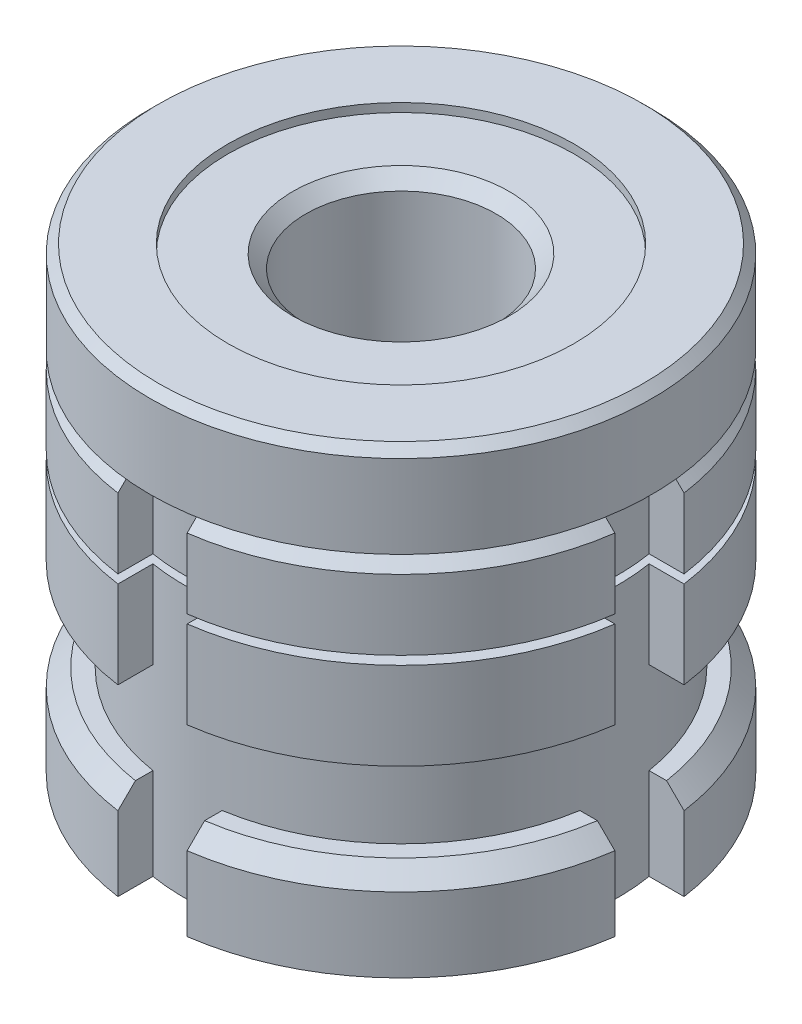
ISO-10303-21;
HEADER;
FILE_DESCRIPTION(('STEP AP214'),'2;1');
FILE_NAME('part.step','',(''),(''),'','','');
FILE_SCHEMA(('AUTOMOTIVE_DESIGN { 1 0 10303 214 1 1 1 1 }'));
ENDSEC;
DATA;
#1=APPLICATION_CONTEXT('core data for automotive mechanical design processes');
#2=APPLICATION_PROTOCOL_DEFINITION('international standard','automotive_design',2000,#1);
#3=PRODUCT_CONTEXT('',#1,'mechanical');
#4=PRODUCT('Part','Part','',(#3));
#5=PRODUCT_RELATED_PRODUCT_CATEGORY('part','',(#4));
#6=PRODUCT_DEFINITION_FORMATION('','',#4);
#7=PRODUCT_DEFINITION_CONTEXT('part definition',#1,'design');
#8=PRODUCT_DEFINITION('design','',#6,#7);
#9=PRODUCT_DEFINITION_SHAPE('','',#8);
#10=(LENGTH_UNIT() NAMED_UNIT(*) SI_UNIT(.MILLI.,.METRE.));
#11=(NAMED_UNIT(*) PLANE_ANGLE_UNIT() SI_UNIT($,.RADIAN.));
#12=(NAMED_UNIT(*) SI_UNIT($,.STERADIAN.) SOLID_ANGLE_UNIT());
#13=UNCERTAINTY_MEASURE_WITH_UNIT(LENGTH_MEASURE(1.E-05),#10,'distance_accuracy_value','');
#14=(GEOMETRIC_REPRESENTATION_CONTEXT(3) GLOBAL_UNCERTAINTY_ASSIGNED_CONTEXT((#13)) GLOBAL_UNIT_ASSIGNED_CONTEXT((#10,
#11,#12)) REPRESENTATION_CONTEXT('',''));
#15=CARTESIAN_POINT('',(0.,0.,0.));
#16=DIRECTION('',(0.,0.,1.));
#17=DIRECTION('',(1.,0.,0.));
#18=AXIS2_PLACEMENT_3D('',#15,#16,#17);
#19=CARTESIAN_POINT('',(0.,21.2,0.));
#20=DIRECTION('',(0.,-1.,0.));
#21=DIRECTION('',(0.,0.,-1.));
#22=AXIS2_PLACEMENT_3D('',#19,#20,#21);
#23=CYLINDRICAL_SURFACE('',#22,29.);
#24=DIRECTION('',(0.,1.,0.));
#25=VECTOR('',#24,1.);
#26=CARTESIAN_POINT('',(-3.99999999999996,-30.2928724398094,28.7228132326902));
#27=LINE('',#26,#25);
#28=CARTESIAN_POINT('',(-3.99999999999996,11.1,28.7228132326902));
#29=VERTEX_POINT('',#28);
#30=CARTESIAN_POINT('',(-3.99999999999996,19.2,28.7228132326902));
#31=VERTEX_POINT('',#30);
#32=EDGE_CURVE('E1115',#29,#31,#27,.T.);
#33=ORIENTED_EDGE('',*,*,#32,.T.);
#34=CARTESIAN_POINT('',(0.,19.2,0.));
#35=DIRECTION('',(0.,1.,0.));
#36=DIRECTION('',(0.,0.,1.));
#37=AXIS2_PLACEMENT_3D('',#34,#35,#36);
#38=CIRCLE('',#37,29.);
#39=CARTESIAN_POINT('',(-28.7228132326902,19.2,3.99999999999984));
#40=VERTEX_POINT('',#39);
#41=EDGE_CURVE('E55',#31,#40,#38,.F.);
#42=ORIENTED_EDGE('',*,*,#41,.T.);
#43=DIRECTION('',(0.,1.,0.));
#44=VECTOR('',#43,1.);
#45=CARTESIAN_POINT('',(-28.7228132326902,-30.2928724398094,3.99999999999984));
#46=LINE('',#45,#44);
#47=CARTESIAN_POINT('',(-28.7228132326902,11.1,3.99999999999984));
#48=VERTEX_POINT('',#47);
#49=EDGE_CURVE('E868',#48,#40,#46,.T.);
#50=ORIENTED_EDGE('',*,*,#49,.F.);
#51=CARTESIAN_POINT('',(0.,11.1,0.));
#52=DIRECTION('',(0.,1.,0.));
#53=DIRECTION('',(0.,0.,1.));
#54=AXIS2_PLACEMENT_3D('',#51,#52,#53);
#55=CIRCLE('',#54,29.);
#56=EDGE_CURVE('E588',#48,#29,#55,.T.);
#57=ORIENTED_EDGE('',*,*,#56,.T.);
#58=EDGE_LOOP('',(#33,#42,#50,#57));
#59=FACE_BOUND('',#58,.T.);
#60=ADVANCED_FACE('F39',(#59),#23,.T.);
#61=DIRECTION('',(0.,1.,0.));
#62=VECTOR('',#61,1.);
#63=CARTESIAN_POINT('',(-28.7228132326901,-30.2928724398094,-4.00000000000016));
#64=LINE('',#63,#62);
#65=CARTESIAN_POINT('',(-28.7228132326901,11.1,-4.00000000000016));
#66=VERTEX_POINT('',#65);
#67=CARTESIAN_POINT('',(-28.7228132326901,19.2,-4.00000000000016));
#68=VERTEX_POINT('',#67);
#69=EDGE_CURVE('E885',#66,#68,#64,.T.);
#70=ORIENTED_EDGE('',*,*,#69,.T.);
#71=CARTESIAN_POINT('',(0.,19.2,0.));
#72=DIRECTION('',(0.,1.,0.));
#73=DIRECTION('',(0.,0.,1.));
#74=AXIS2_PLACEMENT_3D('',#71,#72,#73);
#75=CIRCLE('',#74,29.);
#76=CARTESIAN_POINT('',(-3.99999999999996,19.2,-28.7228132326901));
#77=VERTEX_POINT('',#76);
#78=EDGE_CURVE('E646',#68,#77,#75,.F.);
#79=ORIENTED_EDGE('',*,*,#78,.T.);
#80=DIRECTION('',(0.,1.,0.));
#81=VECTOR('',#80,1.);
#82=CARTESIAN_POINT('',(-3.99999999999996,-30.2928724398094,-28.7228132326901));
#83=LINE('',#82,#81);
#84=CARTESIAN_POINT('',(-3.99999999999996,11.1,-28.7228132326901));
#85=VERTEX_POINT('',#84);
#86=EDGE_CURVE('E463',#85,#77,#83,.T.);
#87=ORIENTED_EDGE('',*,*,#86,.F.);
#88=EDGE_CURVE('E1228',#85,#66,#55,.T.);
#89=ORIENTED_EDGE('',*,*,#88,.T.);
#90=EDGE_LOOP('',(#70,#79,#87,#89));
#91=FACE_BOUND('',#90,.T.);
#92=ADVANCED_FACE('F1245',(#91),#23,.T.);
#93=DIRECTION('',(0.,1.,0.));
#94=VECTOR('',#93,1.);
#95=CARTESIAN_POINT('',(28.7228132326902,-30.2928724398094,3.9999999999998));
#96=LINE('',#95,#94);
#97=CARTESIAN_POINT('',(28.7228132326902,11.1,3.9999999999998));
#98=VERTEX_POINT('',#97);
#99=CARTESIAN_POINT('',(28.7228132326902,19.2,3.9999999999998));
#100=VERTEX_POINT('',#99);
#101=EDGE_CURVE('E1025',#98,#100,#96,.T.);
#102=ORIENTED_EDGE('',*,*,#101,.T.);
#103=CARTESIAN_POINT('',(0.,19.2,0.));
#104=DIRECTION('',(0.,1.,0.));
#105=DIRECTION('',(0.,0.,1.));
#106=AXIS2_PLACEMENT_3D('',#103,#104,#105);
#107=CIRCLE('',#106,29.);
#108=CARTESIAN_POINT('',(3.99999999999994,19.2,28.7228132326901));
#109=VERTEX_POINT('',#108);
#110=EDGE_CURVE('E728',#100,#109,#107,.F.);
#111=ORIENTED_EDGE('',*,*,#110,.T.);
#112=DIRECTION('',(0.,1.,0.));
#113=VECTOR('',#112,1.);
#114=CARTESIAN_POINT('',(3.99999999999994,-30.2928724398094,28.7228132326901));
#115=LINE('',#114,#113);
#116=CARTESIAN_POINT('',(3.99999999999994,11.1,28.7228132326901));
#117=VERTEX_POINT('',#116);
#118=EDGE_CURVE('E1106',#117,#109,#115,.T.);
#119=ORIENTED_EDGE('',*,*,#118,.F.);
#120=EDGE_CURVE('E589',#117,#98,#55,.T.);
#121=ORIENTED_EDGE('',*,*,#120,.T.);
#122=EDGE_LOOP('',(#102,#111,#119,#121));
#123=FACE_BOUND('',#122,.T.);
#124=ADVANCED_FACE('F1104',(#123),#23,.T.);
#125=CARTESIAN_POINT('',(0.,11.1,29.));
#126=DIRECTION('',(0.,1.,0.));
#127=DIRECTION('',(0.,0.,1.));
#128=AXIS2_PLACEMENT_3D('',#125,#126,#127);
#129=PLANE('',#128);
#130=CARTESIAN_POINT('',(0.,11.1,0.));
#131=DIRECTION('',(0.,1.,0.));
#132=DIRECTION('',(0.,0.,1.));
#133=AXIS2_PLACEMENT_3D('',#130,#131,#132);
#134=CIRCLE('',#133,20.);
#135=CARTESIAN_POINT('',(0.,11.1,20.));
#136=VERTEX_POINT('',#135);
#137=EDGE_CURVE('E593',#136,#136,#134,.T.);
#138=ORIENTED_EDGE('',*,*,#137,.T.);
#139=EDGE_LOOP('',(#138));
#140=FACE_BOUND('',#139,.T.);
#141=ORIENTED_EDGE('',*,*,#56,.F.);
#142=DIRECTION('',(1.,0.,0.));
#143=VECTOR('',#142,1.);
#144=CARTESIAN_POINT('',(0.,11.1,3.99999999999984));
#145=LINE('',#144,#143);
#146=CARTESIAN_POINT('',(-24.6779253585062,11.1,3.99999999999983));
#147=VERTEX_POINT('',#146);
#148=EDGE_CURVE('E564',#48,#147,#145,.T.);
#149=ORIENTED_EDGE('',*,*,#148,.T.);
#150=CARTESIAN_POINT('',(0.,11.1,0.));
#151=DIRECTION('',(0.,1.,0.));
#152=DIRECTION('',(0.,0.,1.));
#153=AXIS2_PLACEMENT_3D('',#150,#151,#152);
#154=CIRCLE('',#153,25.);
#155=CARTESIAN_POINT('',(-24.6779253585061,11.1,-4.00000000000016));
#156=VERTEX_POINT('',#155);
#157=EDGE_CURVE('E548',#147,#156,#154,.F.);
#158=ORIENTED_EDGE('',*,*,#157,.T.);
#159=DIRECTION('',(-1.,0.,0.));
#160=VECTOR('',#159,1.);
#161=CARTESIAN_POINT('',(0.,11.1,-4.00000000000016));
#162=LINE('',#161,#160);
#163=EDGE_CURVE('E541',#156,#66,#162,.T.);
#164=ORIENTED_EDGE('',*,*,#163,.T.);
#165=ORIENTED_EDGE('',*,*,#88,.F.);
#166=DIRECTION('',(0.,0.,1.));
#167=VECTOR('',#166,1.);
#168=CARTESIAN_POINT('',(-3.99999999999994,11.1,29.));
#169=LINE('',#168,#167);
#170=CARTESIAN_POINT('',(-3.99999999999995,11.1,-24.6779253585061));
#171=VERTEX_POINT('',#170);
#172=EDGE_CURVE('E527',#85,#171,#169,.T.);
#173=ORIENTED_EDGE('',*,*,#172,.T.);
#174=CARTESIAN_POINT('',(0.,11.1,0.));
#175=DIRECTION('',(0.,1.,0.));
#176=DIRECTION('',(0.,0.,1.));
#177=AXIS2_PLACEMENT_3D('',#174,#175,#176);
#178=CIRCLE('',#177,25.);
#179=CARTESIAN_POINT('',(3.99999999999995,11.1,-24.6779253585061));
#180=VERTEX_POINT('',#179);
#181=EDGE_CURVE('E422',#171,#180,#178,.F.);
#182=ORIENTED_EDGE('',*,*,#181,.T.);
#183=DIRECTION('',(0.,0.,-1.));
#184=VECTOR('',#183,1.);
#185=CARTESIAN_POINT('',(3.99999999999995,11.1,29.));
#186=LINE('',#185,#184);
#187=CARTESIAN_POINT('',(3.99999999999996,11.1,-28.7228132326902));
#188=VERTEX_POINT('',#187);
#189=EDGE_CURVE('E501',#180,#188,#186,.T.);
#190=ORIENTED_EDGE('',*,*,#189,.T.);
#191=CARTESIAN_POINT('',(28.7228132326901,11.1,-4.00000000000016));
#192=VERTEX_POINT('',#191);
#193=EDGE_CURVE('E594',#192,#188,#55,.T.);
#194=ORIENTED_EDGE('',*,*,#193,.F.);
#195=DIRECTION('',(-1.,0.,0.));
#196=VECTOR('',#195,1.);
#197=CARTESIAN_POINT('',(0.,11.1,-4.00000000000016));
#198=LINE('',#197,#196);
#199=CARTESIAN_POINT('',(24.6779253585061,11.1,-4.00000000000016));
#200=VERTEX_POINT('',#199);
#201=EDGE_CURVE('E1072',#192,#200,#198,.T.);
#202=ORIENTED_EDGE('',*,*,#201,.T.);
#203=CARTESIAN_POINT('',(0.,11.1,0.));
#204=DIRECTION('',(0.,1.,0.));
#205=DIRECTION('',(0.,0.,1.));
#206=AXIS2_PLACEMENT_3D('',#203,#204,#205);
#207=CIRCLE('',#206,25.);
#208=CARTESIAN_POINT('',(24.6779253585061,11.1,3.9999999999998));
#209=VERTEX_POINT('',#208);
#210=EDGE_CURVE('E1070',#200,#209,#207,.F.);
#211=ORIENTED_EDGE('',*,*,#210,.T.);
#212=DIRECTION('',(1.,0.,0.));
#213=VECTOR('',#212,1.);
#214=CARTESIAN_POINT('',(0.,11.1,3.99999999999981));
#215=LINE('',#214,#213);
#216=EDGE_CURVE('E992',#209,#98,#215,.T.);
#217=ORIENTED_EDGE('',*,*,#216,.T.);
#218=ORIENTED_EDGE('',*,*,#120,.F.);
#219=DIRECTION('',(0.,0.,-1.));
#220=VECTOR('',#219,1.);
#221=CARTESIAN_POINT('',(3.99999999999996,11.1,29.));
#222=LINE('',#221,#220);
#223=CARTESIAN_POINT('',(3.99999999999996,11.1,24.6779253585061));
#224=VERTEX_POINT('',#223);
#225=EDGE_CURVE('E849',#117,#224,#222,.T.);
#226=ORIENTED_EDGE('',*,*,#225,.T.);
#227=CARTESIAN_POINT('',(0.,11.1,0.));
#228=DIRECTION('',(0.,1.,0.));
#229=DIRECTION('',(0.,0.,1.));
#230=AXIS2_PLACEMENT_3D('',#227,#228,#229);
#231=CIRCLE('',#230,25.);
#232=CARTESIAN_POINT('',(-3.99999999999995,11.1,24.6779253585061));
#233=VERTEX_POINT('',#232);
#234=EDGE_CURVE('E872',#224,#233,#231,.F.);
#235=ORIENTED_EDGE('',*,*,#234,.T.);
#236=DIRECTION('',(0.,0.,1.));
#237=VECTOR('',#236,1.);
#238=CARTESIAN_POINT('',(-3.99999999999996,11.1,29.));
#239=LINE('',#238,#237);
#240=EDGE_CURVE('E1161',#233,#29,#239,.T.);
#241=ORIENTED_EDGE('',*,*,#240,.T.);
#242=EDGE_LOOP('',(#141,#149,#158,#164,#165,#173,#182,#190,#194,#202,#211,#217,#218,#226,#235,#241));
#243=FACE_BOUND('',#242,.T.);
#244=ADVANCED_FACE('F1076',(#140,#243),#129,.F.);
#245=CARTESIAN_POINT('',(0.,10.1,29.));
#246=DIRECTION('',(0.,-1.,0.));
#247=DIRECTION('',(0.,0.,-1.));
#248=AXIS2_PLACEMENT_3D('',#245,#246,#247);
#249=PLANE('',#248);
#250=CARTESIAN_POINT('',(0.,10.1,0.));
#251=DIRECTION('',(0.,1.,0.));
#252=DIRECTION('',(0.,0.,1.));
#253=AXIS2_PLACEMENT_3D('',#250,#251,#252);
#254=CIRCLE('',#253,20.);
#255=CARTESIAN_POINT('',(0.,10.1,20.));
#256=VERTEX_POINT('',#255);
#257=EDGE_CURVE('E573',#256,#256,#254,.T.);
#258=ORIENTED_EDGE('',*,*,#257,.F.);
#259=EDGE_LOOP('',(#258));
#260=FACE_BOUND('',#259,.T.);
#261=CARTESIAN_POINT('',(0.,10.1,0.));
#262=DIRECTION('',(0.,-1.,0.));
#263=DIRECTION('',(0.,0.,-1.));
#264=AXIS2_PLACEMENT_3D('',#261,#262,#263);
#265=CIRCLE('',#264,25.);
#266=CARTESIAN_POINT('',(-24.6779253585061,10.1,-4.00000000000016));
#267=VERTEX_POINT('',#266);
#268=CARTESIAN_POINT('',(-24.6779253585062,10.1,3.99999999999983));
#269=VERTEX_POINT('',#268);
#270=EDGE_CURVE('E545',#267,#269,#265,.F.);
#271=ORIENTED_EDGE('',*,*,#270,.T.);
#272=DIRECTION('',(-1.,0.,0.));
#273=VECTOR('',#272,1.);
#274=CARTESIAN_POINT('',(0.,10.1,3.99999999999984));
#275=LINE('',#274,#273);
#276=CARTESIAN_POINT('',(-28.7228132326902,10.1,3.99999999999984));
#277=VERTEX_POINT('',#276);
#278=EDGE_CURVE('E560',#269,#277,#275,.T.);
#279=ORIENTED_EDGE('',*,*,#278,.T.);
#280=CARTESIAN_POINT('',(0.,10.1,0.));
#281=DIRECTION('',(0.,1.,0.));
#282=DIRECTION('',(0.,0.,1.));
#283=AXIS2_PLACEMENT_3D('',#280,#281,#282);
#284=CIRCLE('',#283,29.);
#285=CARTESIAN_POINT('',(-3.99999999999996,10.1,28.7228132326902));
#286=VERTEX_POINT('',#285);
#287=EDGE_CURVE('E583',#277,#286,#284,.T.);
#288=ORIENTED_EDGE('',*,*,#287,.T.);
#289=DIRECTION('',(0.,0.,-1.));
#290=VECTOR('',#289,1.);
#291=CARTESIAN_POINT('',(-3.99999999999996,10.1,29.));
#292=LINE('',#291,#290);
#293=CARTESIAN_POINT('',(-3.99999999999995,10.1,24.6779253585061));
#294=VERTEX_POINT('',#293);
#295=EDGE_CURVE('E1156',#286,#294,#292,.T.);
#296=ORIENTED_EDGE('',*,*,#295,.T.);
#297=CARTESIAN_POINT('',(0.,10.1,0.));
#298=DIRECTION('',(0.,-1.,0.));
#299=DIRECTION('',(0.,0.,-1.));
#300=AXIS2_PLACEMENT_3D('',#297,#298,#299);
#301=CIRCLE('',#300,25.);
#302=CARTESIAN_POINT('',(3.99999999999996,10.1,24.6779253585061));
#303=VERTEX_POINT('',#302);
#304=EDGE_CURVE('E865',#294,#303,#301,.F.);
#305=ORIENTED_EDGE('',*,*,#304,.T.);
#306=DIRECTION('',(0.,0.,1.));
#307=VECTOR('',#306,1.);
#308=CARTESIAN_POINT('',(3.99999999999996,10.1,29.));
#309=LINE('',#308,#307);
#310=CARTESIAN_POINT('',(3.99999999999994,10.1,28.7228132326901));
#311=VERTEX_POINT('',#310);
#312=EDGE_CURVE('E1153',#303,#311,#309,.T.);
#313=ORIENTED_EDGE('',*,*,#312,.T.);
#314=CARTESIAN_POINT('',(28.7228132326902,10.1,3.9999999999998));
#315=VERTEX_POINT('',#314);
#316=EDGE_CURVE('E584',#311,#315,#284,.T.);
#317=ORIENTED_EDGE('',*,*,#316,.T.);
#318=DIRECTION('',(-1.,0.,0.));
#319=VECTOR('',#318,1.);
#320=CARTESIAN_POINT('',(0.,10.1,3.99999999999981));
#321=LINE('',#320,#319);
#322=CARTESIAN_POINT('',(24.6779253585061,10.1,3.9999999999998));
#323=VERTEX_POINT('',#322);
#324=EDGE_CURVE('E1094',#315,#323,#321,.T.);
#325=ORIENTED_EDGE('',*,*,#324,.T.);
#326=CARTESIAN_POINT('',(0.,10.1,0.));
#327=DIRECTION('',(0.,-1.,0.));
#328=DIRECTION('',(0.,0.,-1.));
#329=AXIS2_PLACEMENT_3D('',#326,#327,#328);
#330=CIRCLE('',#329,25.);
#331=CARTESIAN_POINT('',(24.6779253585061,10.1,-4.00000000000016));
#332=VERTEX_POINT('',#331);
#333=EDGE_CURVE('E1165',#323,#332,#330,.F.);
#334=ORIENTED_EDGE('',*,*,#333,.T.);
#335=DIRECTION('',(1.,0.,0.));
#336=VECTOR('',#335,1.);
#337=CARTESIAN_POINT('',(0.,10.1,-4.00000000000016));
#338=LINE('',#337,#336);
#339=CARTESIAN_POINT('',(28.7228132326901,10.1,-4.00000000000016));
#340=VERTEX_POINT('',#339);
#341=EDGE_CURVE('E1081',#332,#340,#338,.T.);
#342=ORIENTED_EDGE('',*,*,#341,.T.);
#343=CARTESIAN_POINT('',(3.99999999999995,10.1,-28.7228132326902));
#344=VERTEX_POINT('',#343);
#345=EDGE_CURVE('E499',#340,#344,#284,.T.);
#346=ORIENTED_EDGE('',*,*,#345,.T.);
#347=DIRECTION('',(0.,0.,1.));
#348=VECTOR('',#347,1.);
#349=CARTESIAN_POINT('',(3.99999999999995,10.1,29.));
#350=LINE('',#349,#348);
#351=CARTESIAN_POINT('',(3.99999999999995,10.1,-24.6779253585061));
#352=VERTEX_POINT('',#351);
#353=EDGE_CURVE('E483',#344,#352,#350,.T.);
#354=ORIENTED_EDGE('',*,*,#353,.T.);
#355=CARTESIAN_POINT('',(0.,10.1,0.));
#356=DIRECTION('',(0.,-1.,0.));
#357=DIRECTION('',(0.,0.,-1.));
#358=AXIS2_PLACEMENT_3D('',#355,#356,#357);
#359=CIRCLE('',#358,25.);
#360=CARTESIAN_POINT('',(-3.99999999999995,10.1,-24.6779253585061));
#361=VERTEX_POINT('',#360);
#362=EDGE_CURVE('E496',#352,#361,#359,.F.);
#363=ORIENTED_EDGE('',*,*,#362,.T.);
#364=DIRECTION('',(0.,0.,-1.));
#365=VECTOR('',#364,1.);
#366=CARTESIAN_POINT('',(-3.99999999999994,10.1,29.));
#367=LINE('',#366,#365);
#368=CARTESIAN_POINT('',(-3.99999999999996,10.1,-28.7228132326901));
#369=VERTEX_POINT('',#368);
#370=EDGE_CURVE('E524',#361,#369,#367,.T.);
#371=ORIENTED_EDGE('',*,*,#370,.T.);
#372=CARTESIAN_POINT('',(-28.7228132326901,10.1,-4.00000000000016));
#373=VERTEX_POINT('',#372);
#374=EDGE_CURVE('E1307',#369,#373,#284,.T.);
#375=ORIENTED_EDGE('',*,*,#374,.T.);
#376=DIRECTION('',(1.,0.,0.));
#377=VECTOR('',#376,1.);
#378=CARTESIAN_POINT('',(0.,10.1,-4.00000000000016));
#379=LINE('',#378,#377);
#380=EDGE_CURVE('E537',#373,#267,#379,.T.);
#381=ORIENTED_EDGE('',*,*,#380,.T.);
#382=EDGE_LOOP('',(#271,#279,#288,#296,#305,#313,#317,#325,#334,#342,#346,#354,#363,#371,#375,#381));
#383=FACE_BOUND('',#382,.T.);
#384=ADVANCED_FACE('F494',(#260,#383),#249,.F.);
#385=CARTESIAN_POINT('',(0.,0.,0.));
#386=DIRECTION('',(0.,1.,0.));
#387=DIRECTION('',(0.,0.,1.));
#388=AXIS2_PLACEMENT_3D('',#385,#386,#387);
#389=PLANE('',#388);
#390=CARTESIAN_POINT('',(0.,0.,0.));
#391=DIRECTION('',(0.,1.,0.));
#392=DIRECTION('',(0.,0.,1.));
#393=AXIS2_PLACEMENT_3D('',#390,#391,#392);
#394=CIRCLE('',#393,29.);
#395=CARTESIAN_POINT('',(-28.7228132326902,0.,3.99999999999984));
#396=VERTEX_POINT('',#395);
#397=CARTESIAN_POINT('',(-3.99999999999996,0.,28.7228132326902));
#398=VERTEX_POINT('',#397);
#399=EDGE_CURVE('E598',#396,#398,#394,.T.);
#400=ORIENTED_EDGE('',*,*,#399,.F.);
#401=DIRECTION('',(1.,0.,0.));
#402=VECTOR('',#401,1.);
#403=CARTESIAN_POINT('',(0.,0.,3.99999999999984));
#404=LINE('',#403,#402);
#405=CARTESIAN_POINT('',(-24.6779253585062,0.,3.99999999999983));
#406=VERTEX_POINT('',#405);
#407=EDGE_CURVE('E556',#396,#406,#404,.T.);
#408=ORIENTED_EDGE('',*,*,#407,.T.);
#409=CARTESIAN_POINT('',(0.,0.,0.));
#410=DIRECTION('',(0.,-1.,0.));
#411=DIRECTION('',(0.,0.,-1.));
#412=AXIS2_PLACEMENT_3D('',#409,#410,#411);
#413=CIRCLE('',#412,25.);
#414=CARTESIAN_POINT('',(-3.99999999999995,0.,24.6779253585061));
#415=VERTEX_POINT('',#414);
#416=EDGE_CURVE('E1297',#415,#406,#413,.T.);
#417=ORIENTED_EDGE('',*,*,#416,.F.);
#418=DIRECTION('',(0.,0.,1.));
#419=VECTOR('',#418,1.);
#420=CARTESIAN_POINT('',(-3.99999999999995,0.,0.));
#421=LINE('',#420,#419);
#422=EDGE_CURVE('E848',#415,#398,#421,.T.);
#423=ORIENTED_EDGE('',*,*,#422,.T.);
#424=EDGE_LOOP('',(#400,#408,#417,#423));
#425=FACE_BOUND('',#424,.T.);
#426=ADVANCED_FACE('F1260',(#425),#389,.F.);
#427=CARTESIAN_POINT('',(-24.6779253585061,0.,-4.00000000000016));
#428=VERTEX_POINT('',#427);
#429=CARTESIAN_POINT('',(-3.99999999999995,0.,-24.6779253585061));
#430=VERTEX_POINT('',#429);
#431=EDGE_CURVE('E579',#428,#430,#413,.T.);
#432=ORIENTED_EDGE('',*,*,#431,.F.);
#433=DIRECTION('',(-1.,0.,0.));
#434=VECTOR('',#433,1.);
#435=CARTESIAN_POINT('',(0.,0.,-4.00000000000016));
#436=LINE('',#435,#434);
#437=CARTESIAN_POINT('',(-28.7228132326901,0.,-4.00000000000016));
#438=VERTEX_POINT('',#437);
#439=EDGE_CURVE('E533',#428,#438,#436,.T.);
#440=ORIENTED_EDGE('',*,*,#439,.T.);
#441=CARTESIAN_POINT('',(-3.99999999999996,0.,-28.7228132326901));
#442=VERTEX_POINT('',#441);
#443=EDGE_CURVE('E1286',#442,#438,#394,.T.);
#444=ORIENTED_EDGE('',*,*,#443,.F.);
#445=DIRECTION('',(0.,0.,1.));
#446=VECTOR('',#445,1.);
#447=CARTESIAN_POINT('',(-3.99999999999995,0.,0.));
#448=LINE('',#447,#446);
#449=EDGE_CURVE('E520',#442,#430,#448,.T.);
#450=ORIENTED_EDGE('',*,*,#449,.T.);
#451=EDGE_LOOP('',(#432,#440,#444,#450));
#452=FACE_BOUND('',#451,.T.);
#453=ADVANCED_FACE('F1305',(#452),#389,.F.);
#454=CARTESIAN_POINT('',(24.6779253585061,0.,3.9999999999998));
#455=VERTEX_POINT('',#454);
#456=CARTESIAN_POINT('',(3.99999999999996,0.,24.6779253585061));
#457=VERTEX_POINT('',#456);
#458=EDGE_CURVE('E578',#455,#457,#413,.T.);
#459=ORIENTED_EDGE('',*,*,#458,.F.);
#460=DIRECTION('',(1.,0.,0.));
#461=VECTOR('',#460,1.);
#462=CARTESIAN_POINT('',(0.,0.,3.9999999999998));
#463=LINE('',#462,#461);
#464=CARTESIAN_POINT('',(28.7228132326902,0.,3.9999999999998));
#465=VERTEX_POINT('',#464);
#466=EDGE_CURVE('E1084',#455,#465,#463,.T.);
#467=ORIENTED_EDGE('',*,*,#466,.T.);
#468=CARTESIAN_POINT('',(3.99999999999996,0.,28.7228132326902));
#469=VERTEX_POINT('',#468);
#470=EDGE_CURVE('E599',#469,#465,#394,.T.);
#471=ORIENTED_EDGE('',*,*,#470,.F.);
#472=DIRECTION('',(0.,0.,-1.));
#473=VECTOR('',#472,1.);
#474=CARTESIAN_POINT('',(3.99999999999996,0.,0.));
#475=LINE('',#474,#473);
#476=EDGE_CURVE('E1194',#469,#457,#475,.T.);
#477=ORIENTED_EDGE('',*,*,#476,.T.);
#478=EDGE_LOOP('',(#459,#467,#471,#477));
#479=FACE_BOUND('',#478,.T.);
#480=ADVANCED_FACE('F1193',(#479),#389,.F.);
#481=ORIENTED_EDGE('',*,*,#287,.F.);
#482=EDGE_CURVE('E866',#396,#277,#46,.T.);
#483=ORIENTED_EDGE('',*,*,#482,.F.);
#484=ORIENTED_EDGE('',*,*,#399,.T.);
#485=EDGE_CURVE('E1113',#398,#286,#27,.T.);
#486=ORIENTED_EDGE('',*,*,#485,.T.);
#487=EDGE_LOOP('',(#481,#483,#484,#486));
#488=FACE_BOUND('',#487,.T.);
#489=ADVANCED_FACE('F1277',(#488),#23,.T.);
#490=ORIENTED_EDGE('',*,*,#443,.T.);
#491=EDGE_CURVE('E883',#438,#373,#64,.T.);
#492=ORIENTED_EDGE('',*,*,#491,.T.);
#493=ORIENTED_EDGE('',*,*,#374,.F.);
#494=EDGE_CURVE('E952',#442,#369,#83,.T.);
#495=ORIENTED_EDGE('',*,*,#494,.F.);
#496=EDGE_LOOP('',(#490,#492,#493,#495));
#497=FACE_BOUND('',#496,.T.);
#498=ADVANCED_FACE('F1271',(#497),#23,.T.);
#499=ORIENTED_EDGE('',*,*,#470,.T.);
#500=EDGE_CURVE('E1024',#465,#315,#96,.T.);
#501=ORIENTED_EDGE('',*,*,#500,.T.);
#502=ORIENTED_EDGE('',*,*,#316,.F.);
#503=EDGE_CURVE('E1109',#469,#311,#115,.T.);
#504=ORIENTED_EDGE('',*,*,#503,.F.);
#505=EDGE_LOOP('',(#499,#501,#502,#504));
#506=FACE_BOUND('',#505,.T.);
#507=ADVANCED_FACE('F1189',(#506),#23,.T.);
#508=CARTESIAN_POINT('',(0.,-10.6,0.));
#509=DIRECTION('',(0.,-1.,0.));
#510=DIRECTION('',(0.,0.,-1.));
#511=AXIS2_PLACEMENT_3D('',#508,#509,#510);
#512=CYLINDRICAL_SURFACE('',#511,29.);
#513=CARTESIAN_POINT('',(-3.99999999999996,-21.2,28.7228132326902));
#514=VERTEX_POINT('',#513);
#515=CARTESIAN_POINT('',(-3.99999999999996,-12.6,28.7228132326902));
#516=VERTEX_POINT('',#515);
#517=EDGE_CURVE('E859',#514,#516,#27,.T.);
#518=ORIENTED_EDGE('',*,*,#517,.T.);
#519=CARTESIAN_POINT('',(0.,-12.6,0.));
#520=DIRECTION('',(0.,-1.,0.));
#521=DIRECTION('',(0.,0.,-1.));
#522=AXIS2_PLACEMENT_3D('',#519,#520,#521);
#523=CIRCLE('',#522,29.);
#524=CARTESIAN_POINT('',(-28.7228132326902,-12.6,3.99999999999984));
#525=VERTEX_POINT('',#524);
#526=EDGE_CURVE('E776',#516,#525,#523,.T.);
#527=ORIENTED_EDGE('',*,*,#526,.T.);
#528=CARTESIAN_POINT('',(-28.7228132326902,-21.2,3.99999999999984));
#529=VERTEX_POINT('',#528);
#530=EDGE_CURVE('E857',#529,#525,#46,.T.);
#531=ORIENTED_EDGE('',*,*,#530,.F.);
#532=CARTESIAN_POINT('',(0.,-21.2,0.));
#533=DIRECTION('',(0.,-1.,0.));
#534=DIRECTION('',(0.,0.,-1.));
#535=AXIS2_PLACEMENT_3D('',#532,#533,#534);
#536=CIRCLE('',#535,29.);
#537=EDGE_CURVE('E1310',#514,#529,#536,.T.);
#538=ORIENTED_EDGE('',*,*,#537,.F.);
#539=EDGE_LOOP('',(#518,#527,#531,#538));
#540=FACE_BOUND('',#539,.T.);
#541=ADVANCED_FACE('F855',(#540),#512,.T.);
#542=CARTESIAN_POINT('',(-28.7228132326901,-21.2,-4.00000000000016));
#543=VERTEX_POINT('',#542);
#544=CARTESIAN_POINT('',(-28.7228132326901,-12.6,-4.00000000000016));
#545=VERTEX_POINT('',#544);
#546=EDGE_CURVE('E877',#543,#545,#64,.T.);
#547=ORIENTED_EDGE('',*,*,#546,.T.);
#548=CARTESIAN_POINT('',(0.,-12.6,0.));
#549=DIRECTION('',(0.,-1.,0.));
#550=DIRECTION('',(0.,0.,-1.));
#551=AXIS2_PLACEMENT_3D('',#548,#549,#550);
#552=CIRCLE('',#551,29.);
#553=CARTESIAN_POINT('',(-3.99999999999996,-12.6,-28.7228132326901));
#554=VERTEX_POINT('',#553);
#555=EDGE_CURVE('E608',#545,#554,#552,.T.);
#556=ORIENTED_EDGE('',*,*,#555,.T.);
#557=CARTESIAN_POINT('',(-3.99999999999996,-21.2,-28.7228132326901));
#558=VERTEX_POINT('',#557);
#559=EDGE_CURVE('E949',#558,#554,#83,.T.);
#560=ORIENTED_EDGE('',*,*,#559,.F.);
#561=EDGE_CURVE('E568',#543,#558,#536,.T.);
#562=ORIENTED_EDGE('',*,*,#561,.F.);
#563=EDGE_LOOP('',(#547,#556,#560,#562));
#564=FACE_BOUND('',#563,.T.);
#565=ADVANCED_FACE('F1276',(#564),#512,.T.);
#566=CARTESIAN_POINT('',(28.7228132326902,-21.2,3.9999999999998));
#567=VERTEX_POINT('',#566);
#568=CARTESIAN_POINT('',(28.7228132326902,-12.6,3.9999999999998));
#569=VERTEX_POINT('',#568);
#570=EDGE_CURVE('E1018',#567,#569,#96,.T.);
#571=ORIENTED_EDGE('',*,*,#570,.T.);
#572=CARTESIAN_POINT('',(0.,-12.6,0.));
#573=DIRECTION('',(0.,-1.,0.));
#574=DIRECTION('',(0.,0.,-1.));
#575=AXIS2_PLACEMENT_3D('',#572,#573,#574);
#576=CIRCLE('',#575,29.);
#577=CARTESIAN_POINT('',(3.99999999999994,-12.6,28.7228132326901));
#578=VERTEX_POINT('',#577);
#579=EDGE_CURVE('E747',#569,#578,#576,.T.);
#580=ORIENTED_EDGE('',*,*,#579,.T.);
#581=CARTESIAN_POINT('',(3.99999999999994,-21.2,28.7228132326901));
#582=VERTEX_POINT('',#581);
#583=EDGE_CURVE('E1111',#582,#578,#115,.T.);
#584=ORIENTED_EDGE('',*,*,#583,.F.);
#585=EDGE_CURVE('E574',#567,#582,#536,.T.);
#586=ORIENTED_EDGE('',*,*,#585,.F.);
#587=EDGE_LOOP('',(#571,#580,#584,#586));
#588=FACE_BOUND('',#587,.T.);
#589=ADVANCED_FACE('F1258',(#588),#512,.T.);
#590=CARTESIAN_POINT('',(0.,-10.6,0.));
#591=DIRECTION('',(0.,-1.,0.));
#592=DIRECTION('',(0.,0.,-1.));
#593=AXIS2_PLACEMENT_3D('',#590,#591,#592);
#594=PLANE('',#593);
#595=DIRECTION('',(-1.,0.,0.));
#596=VECTOR('',#595,1.);
#597=CARTESIAN_POINT('',(0.,-10.6,3.99999999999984));
#598=LINE('',#597,#596);
#599=CARTESIAN_POINT('',(-24.6779253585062,-10.6,3.99999999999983));
#600=VERTEX_POINT('',#599);
#601=CARTESIAN_POINT('',(-26.7020598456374,-10.6,3.99999999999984));
#602=VERTEX_POINT('',#601);
#603=EDGE_CURVE('E552',#600,#602,#598,.T.);
#604=ORIENTED_EDGE('',*,*,#603,.T.);
#605=CARTESIAN_POINT('',(0.,-10.6,0.));
#606=DIRECTION('',(0.,-1.,0.));
#607=DIRECTION('',(0.,0.,-1.));
#608=AXIS2_PLACEMENT_3D('',#605,#606,#607);
#609=CIRCLE('',#608,27.);
#610=CARTESIAN_POINT('',(-3.99999999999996,-10.6,26.7020598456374));
#611=VERTEX_POINT('',#610);
#612=EDGE_CURVE('E786',#602,#611,#609,.F.);
#613=ORIENTED_EDGE('',*,*,#612,.T.);
#614=DIRECTION('',(0.,0.,-1.));
#615=VECTOR('',#614,1.);
#616=CARTESIAN_POINT('',(-3.99999999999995,-10.6,0.));
#617=LINE('',#616,#615);
#618=CARTESIAN_POINT('',(-3.99999999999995,-10.6,24.6779253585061));
#619=VERTEX_POINT('',#618);
#620=EDGE_CURVE('E840',#611,#619,#617,.T.);
#621=ORIENTED_EDGE('',*,*,#620,.T.);
#622=CARTESIAN_POINT('',(0.,-10.6,0.));
#623=DIRECTION('',(0.,-1.,0.));
#624=DIRECTION('',(0.,0.,-1.));
#625=AXIS2_PLACEMENT_3D('',#622,#623,#624);
#626=CIRCLE('',#625,25.);
#627=EDGE_CURVE('E1892',#619,#600,#626,.T.);
#628=ORIENTED_EDGE('',*,*,#627,.T.);
#629=EDGE_LOOP('',(#604,#613,#621,#628));
#630=FACE_BOUND('',#629,.T.);
#631=ADVANCED_FACE('F838',(#630),#594,.F.);
#632=DIRECTION('',(0.,0.,-1.));
#633=VECTOR('',#632,1.);
#634=CARTESIAN_POINT('',(-3.99999999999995,-10.6,0.));
#635=LINE('',#634,#633);
#636=CARTESIAN_POINT('',(-3.99999999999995,-10.6,-24.6779253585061));
#637=VERTEX_POINT('',#636);
#638=CARTESIAN_POINT('',(-3.99999999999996,-10.6,-26.7020598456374));
#639=VERTEX_POINT('',#638);
#640=EDGE_CURVE('E516',#637,#639,#635,.T.);
#641=ORIENTED_EDGE('',*,*,#640,.T.);
#642=CARTESIAN_POINT('',(0.,-10.6,0.));
#643=DIRECTION('',(0.,-1.,0.));
#644=DIRECTION('',(0.,0.,-1.));
#645=AXIS2_PLACEMENT_3D('',#642,#643,#644);
#646=CIRCLE('',#645,27.);
#647=CARTESIAN_POINT('',(-26.7020598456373,-10.6,-4.00000000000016));
#648=VERTEX_POINT('',#647);
#649=EDGE_CURVE('E621',#639,#648,#646,.F.);
#650=ORIENTED_EDGE('',*,*,#649,.T.);
#651=DIRECTION('',(1.,0.,0.));
#652=VECTOR('',#651,1.);
#653=CARTESIAN_POINT('',(0.,-10.6,-4.00000000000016));
#654=LINE('',#653,#652);
#655=CARTESIAN_POINT('',(-24.6779253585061,-10.6,-4.00000000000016));
#656=VERTEX_POINT('',#655);
#657=EDGE_CURVE('E530',#648,#656,#654,.T.);
#658=ORIENTED_EDGE('',*,*,#657,.T.);
#659=EDGE_CURVE('E577',#656,#637,#626,.T.);
#660=ORIENTED_EDGE('',*,*,#659,.T.);
#661=EDGE_LOOP('',(#641,#650,#658,#660));
#662=FACE_BOUND('',#661,.T.);
#663=ADVANCED_FACE('F1851',(#662),#594,.F.);
#664=DIRECTION('',(0.,0.,1.));
#665=VECTOR('',#664,1.);
#666=CARTESIAN_POINT('',(3.99999999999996,-10.6,0.));
#667=LINE('',#666,#665);
#668=CARTESIAN_POINT('',(3.99999999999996,-10.6,24.6779253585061));
#669=VERTEX_POINT('',#668);
#670=CARTESIAN_POINT('',(3.99999999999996,-10.6,26.7020598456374));
#671=VERTEX_POINT('',#670);
#672=EDGE_CURVE('E1217',#669,#671,#667,.T.);
#673=ORIENTED_EDGE('',*,*,#672,.T.);
#674=CARTESIAN_POINT('',(0.,-10.6,0.));
#675=DIRECTION('',(0.,-1.,0.));
#676=DIRECTION('',(0.,0.,-1.));
#677=AXIS2_PLACEMENT_3D('',#674,#675,#676);
#678=CIRCLE('',#677,27.);
#679=CARTESIAN_POINT('',(26.7020598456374,-10.6,3.9999999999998));
#680=VERTEX_POINT('',#679);
#681=EDGE_CURVE('E767',#671,#680,#678,.F.);
#682=ORIENTED_EDGE('',*,*,#681,.T.);
#683=DIRECTION('',(-1.,0.,0.));
#684=VECTOR('',#683,1.);
#685=CARTESIAN_POINT('',(0.,-10.6,3.9999999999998));
#686=LINE('',#685,#684);
#687=CARTESIAN_POINT('',(24.6779253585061,-10.6,3.9999999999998));
#688=VERTEX_POINT('',#687);
#689=EDGE_CURVE('E1080',#680,#688,#686,.T.);
#690=ORIENTED_EDGE('',*,*,#689,.T.);
#691=EDGE_CURVE('E609',#688,#669,#626,.T.);
#692=ORIENTED_EDGE('',*,*,#691,.T.);
#693=EDGE_LOOP('',(#673,#682,#690,#692));
#694=FACE_BOUND('',#693,.T.);
#695=ADVANCED_FACE('F1344',(#694),#594,.F.);
#696=CARTESIAN_POINT('',(0.,-21.2,0.));
#697=DIRECTION('',(0.,-1.,0.));
#698=DIRECTION('',(0.,0.,-1.));
#699=AXIS2_PLACEMENT_3D('',#696,#697,#698);
#700=PLANE('',#699);
#701=CARTESIAN_POINT('',(0.,-21.2,0.));
#702=DIRECTION('',(0.,-1.,0.));
#703=DIRECTION('',(0.,0.,-1.));
#704=AXIS2_PLACEMENT_3D('',#701,#702,#703);
#705=CIRCLE('',#704,12.4999999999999);
#706=CARTESIAN_POINT('',(0.,-21.2,-12.4999999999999));
#707=VERTEX_POINT('',#706);
#708=EDGE_CURVE('E1812',#707,#707,#705,.F.);
#709=ORIENTED_EDGE('',*,*,#708,.T.);
#710=EDGE_LOOP('',(#709));
#711=FACE_BOUND('',#710,.T.);
#712=DIRECTION('',(1.,0.,0.));
#713=VECTOR('',#712,1.);
#714=CARTESIAN_POINT('',(-24.6779253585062,-21.2,3.99999999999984));
#715=LINE('',#714,#713);
#716=CARTESIAN_POINT('',(-24.6779253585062,-21.2,3.99999999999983));
#717=VERTEX_POINT('',#716);
#718=EDGE_CURVE('E863',#529,#717,#715,.T.);
#719=ORIENTED_EDGE('',*,*,#718,.T.);
#720=CARTESIAN_POINT('',(0.,-21.2,0.));
#721=DIRECTION('',(0.,-1.,0.));
#722=DIRECTION('',(0.,0.,-1.));
#723=AXIS2_PLACEMENT_3D('',#720,#721,#722);
#724=CIRCLE('',#723,25.);
#725=CARTESIAN_POINT('',(-24.6779253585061,-21.2,-4.00000000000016));
#726=VERTEX_POINT('',#725);
#727=EDGE_CURVE('E915',#717,#726,#724,.T.);
#728=ORIENTED_EDGE('',*,*,#727,.T.);
#729=DIRECTION('',(-1.,0.,0.));
#730=VECTOR('',#729,1.);
#731=CARTESIAN_POINT('',(-28.7228132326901,-21.2,-4.00000000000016));
#732=LINE('',#731,#730);
#733=EDGE_CURVE('E897',#726,#543,#732,.T.);
#734=ORIENTED_EDGE('',*,*,#733,.T.);
#735=ORIENTED_EDGE('',*,*,#561,.T.);
#736=DIRECTION('',(0.,0.,1.));
#737=VECTOR('',#736,1.);
#738=CARTESIAN_POINT('',(-3.99999999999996,-21.2,-28.7228132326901));
#739=LINE('',#738,#737);
#740=CARTESIAN_POINT('',(-3.99999999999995,-21.2,-24.6779253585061));
#741=VERTEX_POINT('',#740);
#742=EDGE_CURVE('E425',#558,#741,#739,.T.);
#743=ORIENTED_EDGE('',*,*,#742,.T.);
#744=CARTESIAN_POINT('',(0.,-21.2,0.));
#745=DIRECTION('',(0.,-1.,0.));
#746=DIRECTION('',(0.,0.,-1.));
#747=AXIS2_PLACEMENT_3D('',#744,#745,#746);
#748=CIRCLE('',#747,25.);
#749=CARTESIAN_POINT('',(3.99999999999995,-21.2,-24.6779253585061));
#750=VERTEX_POINT('',#749);
#751=EDGE_CURVE('E439',#741,#750,#748,.T.);
#752=ORIENTED_EDGE('',*,*,#751,.T.);
#753=DIRECTION('',(0.,0.,-1.));
#754=VECTOR('',#753,1.);
#755=CARTESIAN_POINT('',(3.99999999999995,-21.2,-24.6779253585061));
#756=LINE('',#755,#754);
#757=CARTESIAN_POINT('',(3.99999999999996,-21.2,-28.7228132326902));
#758=VERTEX_POINT('',#757);
#759=EDGE_CURVE('E459',#750,#758,#756,.T.);
#760=ORIENTED_EDGE('',*,*,#759,.T.);
#761=CARTESIAN_POINT('',(28.7228132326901,-21.2,-4.00000000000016));
#762=VERTEX_POINT('',#761);
#763=EDGE_CURVE('E569',#758,#762,#536,.T.);
#764=ORIENTED_EDGE('',*,*,#763,.T.);
#765=DIRECTION('',(-1.,0.,0.));
#766=VECTOR('',#765,1.);
#767=CARTESIAN_POINT('',(24.6779253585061,-21.2,-4.00000000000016));
#768=LINE('',#767,#766);
#769=CARTESIAN_POINT('',(24.6779253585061,-21.2,-4.00000000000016));
#770=VERTEX_POINT('',#769);
#771=EDGE_CURVE('E1003',#762,#770,#768,.T.);
#772=ORIENTED_EDGE('',*,*,#771,.T.);
#773=CARTESIAN_POINT('',(0.,-21.2,0.));
#774=DIRECTION('',(0.,-1.,0.));
#775=DIRECTION('',(0.,0.,-1.));
#776=AXIS2_PLACEMENT_3D('',#773,#774,#775);
#777=CIRCLE('',#776,25.);
#778=CARTESIAN_POINT('',(24.6779253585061,-21.2,3.9999999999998));
#779=VERTEX_POINT('',#778);
#780=EDGE_CURVE('E1056',#770,#779,#777,.T.);
#781=ORIENTED_EDGE('',*,*,#780,.T.);
#782=DIRECTION('',(1.,0.,0.));
#783=VECTOR('',#782,1.);
#784=CARTESIAN_POINT('',(28.7228132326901,-21.2,3.9999999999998));
#785=LINE('',#784,#783);
#786=EDGE_CURVE('E1036',#779,#567,#785,.T.);
#787=ORIENTED_EDGE('',*,*,#786,.T.);
#788=ORIENTED_EDGE('',*,*,#585,.T.);
#789=DIRECTION('',(0.,0.,-1.));
#790=VECTOR('',#789,1.);
#791=CARTESIAN_POINT('',(3.99999999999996,-21.2,28.7228132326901));
#792=LINE('',#791,#790);
#793=CARTESIAN_POINT('',(3.99999999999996,-21.2,24.6779253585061));
#794=VERTEX_POINT('',#793);
#795=EDGE_CURVE('E1118',#582,#794,#792,.T.);
#796=ORIENTED_EDGE('',*,*,#795,.T.);
#797=CARTESIAN_POINT('',(0.,-21.2,0.));
#798=DIRECTION('',(0.,-1.,0.));
#799=DIRECTION('',(0.,0.,-1.));
#800=AXIS2_PLACEMENT_3D('',#797,#798,#799);
#801=CIRCLE('',#800,25.);
#802=CARTESIAN_POINT('',(-3.99999999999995,-21.2,24.6779253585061));
#803=VERTEX_POINT('',#802);
#804=EDGE_CURVE('E1132',#794,#803,#801,.T.);
#805=ORIENTED_EDGE('',*,*,#804,.T.);
#806=DIRECTION('',(0.,0.,1.));
#807=VECTOR('',#806,1.);
#808=CARTESIAN_POINT('',(-3.99999999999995,-21.2,24.6779253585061));
#809=LINE('',#808,#807);
#810=EDGE_CURVE('E1200',#803,#514,#809,.T.);
#811=ORIENTED_EDGE('',*,*,#810,.T.);
#812=ORIENTED_EDGE('',*,*,#537,.T.);
#813=EDGE_LOOP('',(#719,#728,#734,#735,#743,#752,#760,#764,#772,#781,#787,#788,#796,#805,#811,#812));
#814=FACE_BOUND('',#813,.T.);
#815=ADVANCED_FACE('F1268',(#711,#814),#700,.T.);
#816=CARTESIAN_POINT('',(0.,-21.2,0.));
#817=DIRECTION('',(0.,1.,0.));
#818=DIRECTION('',(0.,0.,1.));
#819=AXIS2_PLACEMENT_3D('',#816,#817,#818);
#820=CYLINDRICAL_SURFACE('',#819,25.);
#821=DIRECTION('',(0.,1.,0.));
#822=VECTOR('',#821,1.);
#823=CARTESIAN_POINT('',(-24.6779253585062,-30.2928724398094,3.99999999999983));
#824=LINE('',#823,#822);
#825=EDGE_CURVE('E917',#717,#600,#824,.T.);
#826=ORIENTED_EDGE('',*,*,#825,.T.);
#827=ORIENTED_EDGE('',*,*,#627,.F.);
#828=DIRECTION('',(0.,1.,0.));
#829=VECTOR('',#828,1.);
#830=CARTESIAN_POINT('',(-3.99999999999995,-30.2928724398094,24.6779253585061));
#831=LINE('',#830,#829);
#832=EDGE_CURVE('E845',#803,#619,#831,.T.);
#833=ORIENTED_EDGE('',*,*,#832,.F.);
#834=ORIENTED_EDGE('',*,*,#804,.F.);
#835=DIRECTION('',(0.,1.,0.));
#836=VECTOR('',#835,1.);
#837=CARTESIAN_POINT('',(3.99999999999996,-30.2928724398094,24.6779253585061));
#838=LINE('',#837,#836);
#839=EDGE_CURVE('E1130',#794,#669,#838,.T.);
#840=ORIENTED_EDGE('',*,*,#839,.T.);
#841=ORIENTED_EDGE('',*,*,#691,.F.);
#842=DIRECTION('',(0.,1.,0.));
#843=VECTOR('',#842,1.);
#844=CARTESIAN_POINT('',(24.6779253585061,-30.2928724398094,3.9999999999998));
#845=LINE('',#844,#843);
#846=EDGE_CURVE('E418',#779,#688,#845,.T.);
#847=ORIENTED_EDGE('',*,*,#846,.F.);
#848=ORIENTED_EDGE('',*,*,#780,.F.);
#849=DIRECTION('',(0.,1.,0.));
#850=VECTOR('',#849,1.);
#851=CARTESIAN_POINT('',(24.6779253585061,-30.2928724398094,-4.00000000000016));
#852=LINE('',#851,#850);
#853=CARTESIAN_POINT('',(24.6779253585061,-10.6,-4.00000000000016));
#854=VERTEX_POINT('',#853);
#855=EDGE_CURVE('E1058',#770,#854,#852,.T.);
#856=ORIENTED_EDGE('',*,*,#855,.T.);
#857=CARTESIAN_POINT('',(3.99999999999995,-10.6,-24.6779253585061));
#858=VERTEX_POINT('',#857);
#859=EDGE_CURVE('E604',#858,#854,#626,.T.);
#860=ORIENTED_EDGE('',*,*,#859,.F.);
#861=DIRECTION('',(0.,1.,0.));
#862=VECTOR('',#861,1.);
#863=CARTESIAN_POINT('',(3.99999999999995,-30.2928724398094,-24.6779253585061));
#864=LINE('',#863,#862);
#865=EDGE_CURVE('E456',#750,#858,#864,.T.);
#866=ORIENTED_EDGE('',*,*,#865,.F.);
#867=ORIENTED_EDGE('',*,*,#751,.F.);
#868=DIRECTION('',(0.,1.,0.));
#869=VECTOR('',#868,1.);
#870=CARTESIAN_POINT('',(-3.99999999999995,-30.2928724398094,-24.6779253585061));
#871=LINE('',#870,#869);
#872=EDGE_CURVE('E427',#741,#637,#871,.T.);
#873=ORIENTED_EDGE('',*,*,#872,.T.);
#874=ORIENTED_EDGE('',*,*,#659,.F.);
#875=DIRECTION('',(0.,1.,0.));
#876=VECTOR('',#875,1.);
#877=CARTESIAN_POINT('',(-24.6779253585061,-30.2928724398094,-4.00000000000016));
#878=LINE('',#877,#876);
#879=EDGE_CURVE('E904',#726,#656,#878,.T.);
#880=ORIENTED_EDGE('',*,*,#879,.F.);
#881=ORIENTED_EDGE('',*,*,#727,.F.);
#882=EDGE_LOOP('',(#826,#827,#833,#834,#840,#841,#847,#848,#856,#860,#866,#867,#873,#874,#880,#881));
#883=FACE_BOUND('',#882,.T.);
#884=ORIENTED_EDGE('',*,*,#416,.T.);
#885=EDGE_CURVE('E923',#406,#269,#824,.T.);
#886=ORIENTED_EDGE('',*,*,#885,.T.);
#887=ORIENTED_EDGE('',*,*,#270,.F.);
#888=EDGE_CURVE('E911',#428,#267,#878,.T.);
#889=ORIENTED_EDGE('',*,*,#888,.F.);
#890=ORIENTED_EDGE('',*,*,#431,.T.);
#891=EDGE_CURVE('E424',#430,#361,#871,.T.);
#892=ORIENTED_EDGE('',*,*,#891,.T.);
#893=ORIENTED_EDGE('',*,*,#362,.F.);
#894=CARTESIAN_POINT('',(3.99999999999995,0.,-24.6779253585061));
#895=VERTEX_POINT('',#894);
#896=EDGE_CURVE('E455',#895,#352,#864,.T.);
#897=ORIENTED_EDGE('',*,*,#896,.F.);
#898=CARTESIAN_POINT('',(24.6779253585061,0.,-4.00000000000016));
#899=VERTEX_POINT('',#898);
#900=EDGE_CURVE('E575',#895,#899,#413,.T.);
#901=ORIENTED_EDGE('',*,*,#900,.T.);
#902=EDGE_CURVE('E1060',#899,#332,#852,.T.);
#903=ORIENTED_EDGE('',*,*,#902,.T.);
#904=ORIENTED_EDGE('',*,*,#333,.F.);
#905=EDGE_CURVE('E1187',#455,#323,#845,.T.);
#906=ORIENTED_EDGE('',*,*,#905,.F.);
#907=ORIENTED_EDGE('',*,*,#458,.T.);
#908=EDGE_CURVE('E1129',#457,#303,#838,.T.);
#909=ORIENTED_EDGE('',*,*,#908,.T.);
#910=ORIENTED_EDGE('',*,*,#304,.F.);
#911=EDGE_CURVE('E1212',#415,#294,#831,.T.);
#912=ORIENTED_EDGE('',*,*,#911,.F.);
#913=EDGE_LOOP('',(#884,#886,#887,#889,#890,#892,#893,#897,#901,#903,#904,#906,#907,#909,#910,#912));
#914=FACE_BOUND('',#913,.T.);
#915=ADVANCED_FACE('F1144',(#883,#914),#820,.T.);
#916=DIRECTION('',(0.,1.,0.));
#917=VECTOR('',#916,1.);
#918=CARTESIAN_POINT('',(3.99999999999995,-30.2928724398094,-28.7228132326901));
#919=LINE('',#918,#917);
#920=CARTESIAN_POINT('',(3.99999999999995,19.2,-28.7228132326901));
#921=VERTEX_POINT('',#920);
#922=EDGE_CURVE('E465',#188,#921,#919,.T.);
#923=ORIENTED_EDGE('',*,*,#922,.T.);
#924=CARTESIAN_POINT('',(0.,19.2,0.));
#925=DIRECTION('',(0.,1.,0.));
#926=DIRECTION('',(0.,0.,1.));
#927=AXIS2_PLACEMENT_3D('',#924,#925,#926);
#928=CIRCLE('',#927,29.);
#929=CARTESIAN_POINT('',(28.7228132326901,19.2,-4.00000000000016));
#930=VERTEX_POINT('',#929);
#931=EDGE_CURVE('E722',#921,#930,#928,.F.);
#932=ORIENTED_EDGE('',*,*,#931,.T.);
#933=DIRECTION('',(0.,1.,0.));
#934=VECTOR('',#933,1.);
#935=CARTESIAN_POINT('',(28.7228132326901,-30.2928724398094,-4.00000000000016));
#936=LINE('',#935,#934);
#937=EDGE_CURVE('E1007',#192,#930,#936,.T.);
#938=ORIENTED_EDGE('',*,*,#937,.F.);
#939=ORIENTED_EDGE('',*,*,#193,.T.);
#940=EDGE_LOOP('',(#923,#932,#938,#939));
#941=FACE_BOUND('',#940,.T.);
#942=ADVANCED_FACE('F1235',(#941),#23,.T.);
#943=CARTESIAN_POINT('',(0.,13.2647697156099,0.));
#944=DIRECTION('',(0.,1.,0.));
#945=DIRECTION('',(0.,0.,1.));
#946=AXIS2_PLACEMENT_3D('',#943,#944,#945);
#947=CYLINDRICAL_SURFACE('',#946,20.);
#948=ORIENTED_EDGE('',*,*,#137,.F.);
#949=EDGE_LOOP('',(#948));
#950=FACE_BOUND('',#949,.T.);
#951=ORIENTED_EDGE('',*,*,#257,.T.);
#952=EDGE_LOOP('',(#951));
#953=FACE_BOUND('',#952,.T.);
#954=ADVANCED_FACE('F1259',(#950,#953),#947,.T.);
#955=ORIENTED_EDGE('',*,*,#900,.F.);
#956=DIRECTION('',(0.,0.,-1.));
#957=VECTOR('',#956,1.);
#958=CARTESIAN_POINT('',(3.99999999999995,0.,0.));
#959=LINE('',#958,#957);
#960=CARTESIAN_POINT('',(3.99999999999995,0.,-28.7228132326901));
#961=VERTEX_POINT('',#960);
#962=EDGE_CURVE('E486',#895,#961,#959,.T.);
#963=ORIENTED_EDGE('',*,*,#962,.T.);
#964=CARTESIAN_POINT('',(28.7228132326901,0.,-4.00000000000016));
#965=VERTEX_POINT('',#964);
#966=EDGE_CURVE('E603',#965,#961,#394,.T.);
#967=ORIENTED_EDGE('',*,*,#966,.F.);
#968=DIRECTION('',(-1.,0.,0.));
#969=VECTOR('',#968,1.);
#970=CARTESIAN_POINT('',(0.,0.,-4.00000000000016));
#971=LINE('',#970,#969);
#972=EDGE_CURVE('E1087',#965,#899,#971,.T.);
#973=ORIENTED_EDGE('',*,*,#972,.T.);
#974=EDGE_LOOP('',(#955,#963,#967,#973));
#975=FACE_BOUND('',#974,.T.);
#976=ADVANCED_FACE('F1180',(#975),#389,.F.);
#977=ORIENTED_EDGE('',*,*,#966,.T.);
#978=EDGE_CURVE('E464',#961,#344,#919,.T.);
#979=ORIENTED_EDGE('',*,*,#978,.T.);
#980=ORIENTED_EDGE('',*,*,#345,.F.);
#981=EDGE_CURVE('E1005',#965,#340,#936,.T.);
#982=ORIENTED_EDGE('',*,*,#981,.F.);
#983=EDGE_LOOP('',(#977,#979,#980,#982));
#984=FACE_BOUND('',#983,.T.);
#985=ADVANCED_FACE('F1246',(#984),#23,.T.);
#986=CARTESIAN_POINT('',(3.99999999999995,-12.6,-28.7228132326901));
#987=VERTEX_POINT('',#986);
#988=EDGE_CURVE('E460',#758,#987,#919,.T.);
#989=ORIENTED_EDGE('',*,*,#988,.T.);
#990=CARTESIAN_POINT('',(0.,-12.6,0.));
#991=DIRECTION('',(0.,-1.,0.));
#992=DIRECTION('',(0.,0.,-1.));
#993=AXIS2_PLACEMENT_3D('',#990,#991,#992);
#994=CIRCLE('',#993,29.);
#995=CARTESIAN_POINT('',(28.7228132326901,-12.6,-4.00000000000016));
#996=VERTEX_POINT('',#995);
#997=EDGE_CURVE('E691',#987,#996,#994,.T.);
#998=ORIENTED_EDGE('',*,*,#997,.T.);
#999=EDGE_CURVE('E999',#762,#996,#936,.T.);
#1000=ORIENTED_EDGE('',*,*,#999,.F.);
#1001=ORIENTED_EDGE('',*,*,#763,.F.);
#1002=EDGE_LOOP('',(#989,#998,#1000,#1001));
#1003=FACE_BOUND('',#1002,.T.);
#1004=ADVANCED_FACE('F997',(#1003),#512,.T.);
#1005=DIRECTION('',(1.,0.,0.));
#1006=VECTOR('',#1005,1.);
#1007=CARTESIAN_POINT('',(0.,-10.6,-4.00000000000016));
#1008=LINE('',#1007,#1006);
#1009=CARTESIAN_POINT('',(26.7020598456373,-10.6,-4.00000000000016));
#1010=VERTEX_POINT('',#1009);
#1011=EDGE_CURVE('E988',#854,#1010,#1008,.T.);
#1012=ORIENTED_EDGE('',*,*,#1011,.T.);
#1013=CARTESIAN_POINT('',(0.,-10.6,0.));
#1014=DIRECTION('',(0.,-1.,0.));
#1015=DIRECTION('',(0.,0.,-1.));
#1016=AXIS2_PLACEMENT_3D('',#1013,#1014,#1015);
#1017=CIRCLE('',#1016,27.);
#1018=CARTESIAN_POINT('',(3.99999999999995,-10.6,-26.7020598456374));
#1019=VERTEX_POINT('',#1018);
#1020=EDGE_CURVE('E700',#1010,#1019,#1017,.F.);
#1021=ORIENTED_EDGE('',*,*,#1020,.T.);
#1022=DIRECTION('',(0.,0.,1.));
#1023=VECTOR('',#1022,1.);
#1024=CARTESIAN_POINT('',(3.99999999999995,-10.6,0.));
#1025=LINE('',#1024,#1023);
#1026=EDGE_CURVE('E508',#1019,#858,#1025,.T.);
#1027=ORIENTED_EDGE('',*,*,#1026,.T.);
#1028=ORIENTED_EDGE('',*,*,#859,.T.);
#1029=EDGE_LOOP('',(#1012,#1021,#1027,#1028));
#1030=FACE_BOUND('',#1029,.T.);
#1031=ADVANCED_FACE('F987',(#1030),#594,.F.);
#1032=CARTESIAN_POINT('',(3.99999999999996,-30.2928724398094,28.7228132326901));
#1033=DIRECTION('',(1.,0.,0.));
#1034=DIRECTION('',(0.,0.,-1.));
#1035=AXIS2_PLACEMENT_3D('',#1032,#1033,#1034);
#1036=PLANE('',#1035);
#1037=ORIENTED_EDGE('',*,*,#583,.T.);
#1038=CARTESIAN_POINT('',(3.99999999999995,-12.6,28.7228132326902));
#1039=CARTESIAN_POINT('',(3.99999999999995,-12.266541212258,28.3861451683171));
#1040=CARTESIAN_POINT('',(3.99999999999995,-11.9331451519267,28.0494150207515));
#1041=CARTESIAN_POINT('',(3.99999999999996,-11.2664784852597,27.3758305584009));
#1042=CARTESIAN_POINT('',(3.99999999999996,-10.9332078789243,27.0389762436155));
#1043=CARTESIAN_POINT('',(3.99999999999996,-10.6,26.7020598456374));
#1044=B_SPLINE_CURVE_WITH_KNOTS('',3,(#1038,#1039,#1040,#1041,#1042,#1043),.UNSPECIFIED.,.F.,
.F.,(4,2,4),(0.,1.42156995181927,2.84313990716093),.UNSPECIFIED.);
#1045=EDGE_CURVE('E761',#578,#671,#1044,.T.);
#1046=ORIENTED_EDGE('',*,*,#1045,.T.);
#1047=ORIENTED_EDGE('',*,*,#672,.F.);
#1048=ORIENTED_EDGE('',*,*,#839,.F.);
#1049=ORIENTED_EDGE('',*,*,#795,.F.);
#1050=EDGE_LOOP('',(#1037,#1046,#1047,#1048,#1049));
#1051=FACE_BOUND('',#1050,.T.);
#1052=ADVANCED_FACE('F757',(#1051),#1036,.F.);
#1053=CARTESIAN_POINT('',(-3.99999999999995,-30.2928724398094,24.6779253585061));
#1054=DIRECTION('',(-1.,0.,0.));
#1055=DIRECTION('',(0.,0.,1.));
#1056=AXIS2_PLACEMENT_3D('',#1053,#1054,#1055);
#1057=PLANE('',#1056);
#1058=ORIENTED_EDGE('',*,*,#620,.F.);
#1059=CARTESIAN_POINT('',(-3.99999999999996,-10.6,26.7020598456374));
#1060=CARTESIAN_POINT('',(-3.99999999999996,-10.9332078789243,27.0389762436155));
#1061=CARTESIAN_POINT('',(-3.99999999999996,-11.2664784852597,27.3758305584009));
#1062=CARTESIAN_POINT('',(-3.99999999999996,-11.9331451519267,28.0494150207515));
#1063=CARTESIAN_POINT('',(-3.99999999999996,-12.266541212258,28.3861451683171));
#1064=CARTESIAN_POINT('',(-3.99999999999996,-12.6,28.7228132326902));
#1065=B_SPLINE_CURVE_WITH_KNOTS('',3,(#1059,#1060,#1061,#1062,#1063,#1064),.UNSPECIFIED.,.F.,
.F.,(4,2,4),(0.,1.42156995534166,2.84313990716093),.UNSPECIFIED.);
#1066=EDGE_CURVE('E823',#611,#516,#1065,.T.);
#1067=ORIENTED_EDGE('',*,*,#1066,.T.);
#1068=ORIENTED_EDGE('',*,*,#517,.F.);
#1069=ORIENTED_EDGE('',*,*,#810,.F.);
#1070=ORIENTED_EDGE('',*,*,#832,.T.);
#1071=EDGE_LOOP('',(#1058,#1067,#1068,#1069,#1070));
#1072=FACE_BOUND('',#1071,.T.);
#1073=ADVANCED_FACE('F843',(#1072),#1057,.F.);
#1074=CARTESIAN_POINT('',(24.6779253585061,-30.2928724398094,-4.00000000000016));
#1075=DIRECTION('',(0.,0.,-1.));
#1076=DIRECTION('',(-1.,0.,0.));
#1077=AXIS2_PLACEMENT_3D('',#1074,#1075,#1076);
#1078=PLANE('',#1077);
#1079=ORIENTED_EDGE('',*,*,#999,.T.);
#1080=CARTESIAN_POINT('',(28.7228132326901,-12.6,-4.00000000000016));
#1081=CARTESIAN_POINT('',(28.3861451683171,-12.266541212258,-4.00000000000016));
#1082=CARTESIAN_POINT('',(28.0494150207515,-11.9331451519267,-4.00000000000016));
#1083=CARTESIAN_POINT('',(27.3758305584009,-11.2664784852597,-4.00000000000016));
#1084=CARTESIAN_POINT('',(27.0389762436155,-10.9332078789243,-4.00000000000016));
#1085=CARTESIAN_POINT('',(26.7020598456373,-10.6,-4.00000000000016));
#1086=B_SPLINE_CURVE_WITH_KNOTS('',3,(#1080,#1081,#1082,#1083,#1084,#1085),.UNSPECIFIED.,.F.,
.F.,(4,2,4),(0.,1.42156995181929,2.84313990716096),.UNSPECIFIED.);
#1087=EDGE_CURVE('E695',#996,#1010,#1086,.T.);
#1088=ORIENTED_EDGE('',*,*,#1087,.T.);
#1089=ORIENTED_EDGE('',*,*,#1011,.F.);
#1090=ORIENTED_EDGE('',*,*,#855,.F.);
#1091=ORIENTED_EDGE('',*,*,#771,.F.);
#1092=EDGE_LOOP('',(#1079,#1088,#1089,#1090,#1091));
#1093=FACE_BOUND('',#1092,.T.);
#1094=ADVANCED_FACE('F709',(#1093),#1078,.F.);
#1095=CARTESIAN_POINT('',(28.7228132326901,-30.2928724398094,3.9999999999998));
#1096=DIRECTION('',(0.,0.,1.));
#1097=DIRECTION('',(1.,0.,0.));
#1098=AXIS2_PLACEMENT_3D('',#1095,#1096,#1097);
#1099=PLANE('',#1098);
#1100=ORIENTED_EDGE('',*,*,#689,.F.);
#1101=CARTESIAN_POINT('',(26.7020598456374,-10.6,3.9999999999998));
#1102=CARTESIAN_POINT('',(27.0389762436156,-10.9332078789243,3.9999999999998));
#1103=CARTESIAN_POINT('',(27.3758305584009,-11.2664784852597,3.9999999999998));
#1104=CARTESIAN_POINT('',(28.0494150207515,-11.9331451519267,3.9999999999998));
#1105=CARTESIAN_POINT('',(28.3861451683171,-12.266541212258,3.9999999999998));
#1106=CARTESIAN_POINT('',(28.7228132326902,-12.6,3.9999999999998));
#1107=B_SPLINE_CURVE_WITH_KNOTS('',3,(#1101,#1102,#1103,#1104,#1105,#1106),.UNSPECIFIED.,.F.,
.F.,(4,2,4),(0.,1.42156995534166,2.84313990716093),.UNSPECIFIED.);
#1108=EDGE_CURVE('E770',#680,#569,#1107,.T.);
#1109=ORIENTED_EDGE('',*,*,#1108,.T.);
#1110=ORIENTED_EDGE('',*,*,#570,.F.);
#1111=ORIENTED_EDGE('',*,*,#786,.F.);
#1112=ORIENTED_EDGE('',*,*,#846,.T.);
#1113=EDGE_LOOP('',(#1100,#1109,#1110,#1111,#1112));
#1114=FACE_BOUND('',#1113,.T.);
#1115=ADVANCED_FACE('F1404',(#1114),#1099,.F.);
#1116=CARTESIAN_POINT('',(3.99999999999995,-30.2928724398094,-24.6779253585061));
#1117=DIRECTION('',(1.,0.,0.));
#1118=DIRECTION('',(0.,0.,-1.));
#1119=AXIS2_PLACEMENT_3D('',#1116,#1117,#1118);
#1120=PLANE('',#1119);
#1121=ORIENTED_EDGE('',*,*,#1026,.F.);
#1122=CARTESIAN_POINT('',(3.99999999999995,-10.6,-26.7020598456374));
#1123=CARTESIAN_POINT('',(3.99999999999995,-10.9332078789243,-27.0389762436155));
#1124=CARTESIAN_POINT('',(3.99999999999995,-11.2664784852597,-27.3758305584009));
#1125=CARTESIAN_POINT('',(3.99999999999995,-11.9331451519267,-28.0494150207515));
#1126=CARTESIAN_POINT('',(3.99999999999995,-12.266541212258,-28.3861451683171));
#1127=CARTESIAN_POINT('',(3.99999999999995,-12.6,-28.7228132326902));
#1128=B_SPLINE_CURVE_WITH_KNOTS('',3,(#1122,#1123,#1124,#1125,#1126,#1127),.UNSPECIFIED.,.F.,
.F.,(4,2,4),(0.,1.42156995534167,2.84313990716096),.UNSPECIFIED.);
#1129=EDGE_CURVE('E975',#1019,#987,#1128,.T.);
#1130=ORIENTED_EDGE('',*,*,#1129,.T.);
#1131=ORIENTED_EDGE('',*,*,#988,.F.);
#1132=ORIENTED_EDGE('',*,*,#759,.F.);
#1133=ORIENTED_EDGE('',*,*,#865,.T.);
#1134=EDGE_LOOP('',(#1121,#1130,#1131,#1132,#1133));
#1135=FACE_BOUND('',#1134,.T.);
#1136=ADVANCED_FACE('F990',(#1135),#1120,.F.);
#1137=CARTESIAN_POINT('',(-3.99999999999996,-30.2928724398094,-28.7228132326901));
#1138=DIRECTION('',(-1.,0.,0.));
#1139=DIRECTION('',(0.,0.,1.));
#1140=AXIS2_PLACEMENT_3D('',#1137,#1138,#1139);
#1141=PLANE('',#1140);
#1142=ORIENTED_EDGE('',*,*,#559,.T.);
#1143=CARTESIAN_POINT('',(-3.99999999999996,-12.6,-28.7228132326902));
#1144=CARTESIAN_POINT('',(-3.99999999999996,-12.266541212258,-28.3861451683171));
#1145=CARTESIAN_POINT('',(-3.99999999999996,-11.9331451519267,-28.0494150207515));
#1146=CARTESIAN_POINT('',(-3.99999999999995,-11.2664784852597,-27.3758305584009));
#1147=CARTESIAN_POINT('',(-3.99999999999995,-10.9332078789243,-27.0389762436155));
#1148=CARTESIAN_POINT('',(-3.99999999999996,-10.6,-26.7020598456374));
#1149=B_SPLINE_CURVE_WITH_KNOTS('',3,(#1143,#1144,#1145,#1146,#1147,#1148),.UNSPECIFIED.,.F.,
.F.,(4,2,4),(0.,1.42156995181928,2.84313990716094),.UNSPECIFIED.);
#1150=EDGE_CURVE('E613',#554,#639,#1149,.T.);
#1151=ORIENTED_EDGE('',*,*,#1150,.T.);
#1152=ORIENTED_EDGE('',*,*,#640,.F.);
#1153=ORIENTED_EDGE('',*,*,#872,.F.);
#1154=ORIENTED_EDGE('',*,*,#742,.F.);
#1155=EDGE_LOOP('',(#1142,#1151,#1152,#1153,#1154));
#1156=FACE_BOUND('',#1155,.T.);
#1157=ADVANCED_FACE('F633',(#1156),#1141,.F.);
#1158=CARTESIAN_POINT('',(-28.7228132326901,-30.2928724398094,-4.00000000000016));
#1159=DIRECTION('',(0.,0.,-1.));
#1160=DIRECTION('',(-1.,0.,0.));
#1161=AXIS2_PLACEMENT_3D('',#1158,#1159,#1160);
#1162=PLANE('',#1161);
#1163=ORIENTED_EDGE('',*,*,#657,.F.);
#1164=CARTESIAN_POINT('',(-26.7020598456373,-10.6,-4.00000000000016));
#1165=CARTESIAN_POINT('',(-27.0389762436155,-10.9332078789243,-4.00000000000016));
#1166=CARTESIAN_POINT('',(-27.3758305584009,-11.2664784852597,-4.00000000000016));
#1167=CARTESIAN_POINT('',(-28.0494150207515,-11.9331451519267,-4.00000000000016));
#1168=CARTESIAN_POINT('',(-28.3861451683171,-12.266541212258,-4.00000000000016));
#1169=CARTESIAN_POINT('',(-28.7228132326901,-12.6,-4.00000000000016));
#1170=B_SPLINE_CURVE_WITH_KNOTS('',3,(#1164,#1165,#1166,#1167,#1168,#1169),.UNSPECIFIED.,.F.,
.F.,(4,2,4),(0.,1.42156995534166,2.84313990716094),.UNSPECIFIED.);
#1171=EDGE_CURVE('E685',#648,#545,#1170,.T.);
#1172=ORIENTED_EDGE('',*,*,#1171,.T.);
#1173=ORIENTED_EDGE('',*,*,#546,.F.);
#1174=ORIENTED_EDGE('',*,*,#733,.F.);
#1175=ORIENTED_EDGE('',*,*,#879,.T.);
#1176=EDGE_LOOP('',(#1163,#1172,#1173,#1174,#1175));
#1177=FACE_BOUND('',#1176,.T.);
#1178=ADVANCED_FACE('F680',(#1177),#1162,.F.);
#1179=CARTESIAN_POINT('',(-24.6779253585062,-30.2928724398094,3.99999999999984));
#1180=DIRECTION('',(0.,0.,1.));
#1181=DIRECTION('',(1.,0.,0.));
#1182=AXIS2_PLACEMENT_3D('',#1179,#1180,#1181);
#1183=PLANE('',#1182);
#1184=ORIENTED_EDGE('',*,*,#530,.T.);
#1185=CARTESIAN_POINT('',(-28.7228132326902,-12.6,3.99999999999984));
#1186=CARTESIAN_POINT('',(-28.3861451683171,-12.266541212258,3.99999999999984));
#1187=CARTESIAN_POINT('',(-28.0494150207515,-11.9331451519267,3.99999999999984));
#1188=CARTESIAN_POINT('',(-27.3758305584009,-11.2664784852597,3.99999999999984));
#1189=CARTESIAN_POINT('',(-27.0389762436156,-10.9332078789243,3.99999999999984));
#1190=CARTESIAN_POINT('',(-26.7020598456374,-10.6,3.99999999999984));
#1191=B_SPLINE_CURVE_WITH_KNOTS('',3,(#1185,#1186,#1187,#1188,#1189,#1190),.UNSPECIFIED.,.F.,
.F.,(4,2,4),(0.,1.42156995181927,2.84313990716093),.UNSPECIFIED.);
#1192=EDGE_CURVE('E780',#525,#602,#1191,.T.);
#1193=ORIENTED_EDGE('',*,*,#1192,.T.);
#1194=ORIENTED_EDGE('',*,*,#603,.F.);
#1195=ORIENTED_EDGE('',*,*,#825,.F.);
#1196=ORIENTED_EDGE('',*,*,#718,.F.);
#1197=EDGE_LOOP('',(#1184,#1193,#1194,#1195,#1196));
#1198=FACE_BOUND('',#1197,.T.);
#1199=ADVANCED_FACE('F797',(#1198),#1183,.F.);
#1200=ORIENTED_EDGE('',*,*,#908,.F.);
#1201=ORIENTED_EDGE('',*,*,#476,.F.);
#1202=ORIENTED_EDGE('',*,*,#503,.T.);
#1203=ORIENTED_EDGE('',*,*,#312,.F.);
#1204=EDGE_LOOP('',(#1200,#1201,#1202,#1203));
#1205=FACE_BOUND('',#1204,.T.);
#1206=ADVANCED_FACE('F756',(#1205),#1036,.F.);
#1207=ORIENTED_EDGE('',*,*,#485,.F.);
#1208=ORIENTED_EDGE('',*,*,#422,.F.);
#1209=ORIENTED_EDGE('',*,*,#911,.T.);
#1210=ORIENTED_EDGE('',*,*,#295,.F.);
#1211=EDGE_LOOP('',(#1207,#1208,#1209,#1210));
#1212=FACE_BOUND('',#1211,.T.);
#1213=ADVANCED_FACE('F1298',(#1212),#1057,.F.);
#1214=ORIENTED_EDGE('',*,*,#902,.F.);
#1215=ORIENTED_EDGE('',*,*,#972,.F.);
#1216=ORIENTED_EDGE('',*,*,#981,.T.);
#1217=ORIENTED_EDGE('',*,*,#341,.F.);
#1218=EDGE_LOOP('',(#1214,#1215,#1216,#1217));
#1219=FACE_BOUND('',#1218,.T.);
#1220=ADVANCED_FACE('F708',(#1219),#1078,.F.);
#1221=ORIENTED_EDGE('',*,*,#500,.F.);
#1222=ORIENTED_EDGE('',*,*,#466,.F.);
#1223=ORIENTED_EDGE('',*,*,#905,.T.);
#1224=ORIENTED_EDGE('',*,*,#324,.F.);
#1225=EDGE_LOOP('',(#1221,#1222,#1223,#1224));
#1226=FACE_BOUND('',#1225,.T.);
#1227=ADVANCED_FACE('F1186',(#1226),#1099,.F.);
#1228=ORIENTED_EDGE('',*,*,#891,.F.);
#1229=ORIENTED_EDGE('',*,*,#449,.F.);
#1230=ORIENTED_EDGE('',*,*,#494,.T.);
#1231=ORIENTED_EDGE('',*,*,#370,.F.);
#1232=EDGE_LOOP('',(#1228,#1229,#1230,#1231));
#1233=FACE_BOUND('',#1232,.T.);
#1234=ADVANCED_FACE('F632',(#1233),#1141,.F.);
#1235=ORIENTED_EDGE('',*,*,#978,.F.);
#1236=ORIENTED_EDGE('',*,*,#962,.F.);
#1237=ORIENTED_EDGE('',*,*,#896,.T.);
#1238=ORIENTED_EDGE('',*,*,#353,.F.);
#1239=EDGE_LOOP('',(#1235,#1236,#1237,#1238));
#1240=FACE_BOUND('',#1239,.T.);
#1241=ADVANCED_FACE('F482',(#1240),#1120,.F.);
#1242=ORIENTED_EDGE('',*,*,#885,.F.);
#1243=ORIENTED_EDGE('',*,*,#407,.F.);
#1244=ORIENTED_EDGE('',*,*,#482,.T.);
#1245=ORIENTED_EDGE('',*,*,#278,.F.);
#1246=EDGE_LOOP('',(#1242,#1243,#1244,#1245));
#1247=FACE_BOUND('',#1246,.T.);
#1248=ADVANCED_FACE('F796',(#1247),#1183,.F.);
#1249=ORIENTED_EDGE('',*,*,#491,.F.);
#1250=ORIENTED_EDGE('',*,*,#439,.F.);
#1251=ORIENTED_EDGE('',*,*,#888,.T.);
#1252=ORIENTED_EDGE('',*,*,#380,.F.);
#1253=EDGE_LOOP('',(#1249,#1250,#1251,#1252));
#1254=FACE_BOUND('',#1253,.T.);
#1255=ADVANCED_FACE('F679',(#1254),#1162,.F.);
#1256=DIRECTION('',(0.,0.,1.));
#1257=VECTOR('',#1256,1.);
#1258=CARTESIAN_POINT('',(-3.99999999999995,21.2,24.6779253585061));
#1259=LINE('',#1258,#1257);
#1260=CARTESIAN_POINT('',(-3.99999999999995,21.2,24.6779253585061));
#1261=VERTEX_POINT('',#1260);
#1262=CARTESIAN_POINT('',(-3.99999999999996,21.2,26.7020598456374));
#1263=VERTEX_POINT('',#1262);
#1264=EDGE_CURVE('E1201',#1261,#1263,#1259,.T.);
#1265=ORIENTED_EDGE('',*,*,#1264,.T.);
#1266=CARTESIAN_POINT('',(-3.99999999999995,21.2,26.7020598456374));
#1267=CARTESIAN_POINT('',(-3.99999999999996,20.8667921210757,27.0389762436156));
#1268=CARTESIAN_POINT('',(-3.99999999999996,20.5335215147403,27.3758305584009));
#1269=CARTESIAN_POINT('',(-3.99999999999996,19.8668548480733,28.0494150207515));
#1270=CARTESIAN_POINT('',(-3.99999999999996,19.533458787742,28.3861451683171));
#1271=CARTESIAN_POINT('',(-3.99999999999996,19.2,28.7228132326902));
#1272=B_SPLINE_CURVE_WITH_KNOTS('',3,(#1266,#1267,#1268,#1269,#1270,#1271),.UNSPECIFIED.,.F.,
.F.,(4,2,4),(0.,1.42156995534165,2.84313990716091),.UNSPECIFIED.);
#1273=EDGE_CURVE('E63',#1263,#31,#1272,.T.);
#1274=ORIENTED_EDGE('',*,*,#1273,.T.);
#1275=ORIENTED_EDGE('',*,*,#32,.F.);
#1276=ORIENTED_EDGE('',*,*,#240,.F.);
#1277=EDGE_CURVE('E1139',#233,#1261,#831,.T.);
#1278=ORIENTED_EDGE('',*,*,#1277,.T.);
#1279=EDGE_LOOP('',(#1265,#1274,#1275,#1276,#1278));
#1280=FACE_BOUND('',#1279,.T.);
#1281=ADVANCED_FACE('F754',(#1280),#1057,.F.);
#1282=ORIENTED_EDGE('',*,*,#118,.T.);
#1283=CARTESIAN_POINT('',(3.99999999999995,19.2,28.7228132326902));
#1284=CARTESIAN_POINT('',(3.99999999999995,19.533458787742,28.3861451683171));
#1285=CARTESIAN_POINT('',(3.99999999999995,19.8668548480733,28.0494150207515));
#1286=CARTESIAN_POINT('',(3.99999999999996,20.5335215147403,27.3758305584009));
#1287=CARTESIAN_POINT('',(3.99999999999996,20.8667921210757,27.0389762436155));
#1288=CARTESIAN_POINT('',(3.99999999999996,21.2,26.7020598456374));
#1289=B_SPLINE_CURVE_WITH_KNOTS('',3,(#1283,#1284,#1285,#1286,#1287,#1288),.UNSPECIFIED.,.F.,
.F.,(4,2,4),(0.,1.42156995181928,2.84313990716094),.UNSPECIFIED.);
#1290=CARTESIAN_POINT('',(3.99999999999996,21.2,26.7020598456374));
#1291=VERTEX_POINT('',#1290);
#1292=EDGE_CURVE('E739',#109,#1291,#1289,.T.);
#1293=ORIENTED_EDGE('',*,*,#1292,.T.);
#1294=DIRECTION('',(0.,0.,-1.));
#1295=VECTOR('',#1294,1.);
#1296=CARTESIAN_POINT('',(3.99999999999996,21.2,28.7228132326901));
#1297=LINE('',#1296,#1295);
#1298=CARTESIAN_POINT('',(3.99999999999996,21.2,24.6779253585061));
#1299=VERTEX_POINT('',#1298);
#1300=EDGE_CURVE('E1197',#1291,#1299,#1297,.T.);
#1301=ORIENTED_EDGE('',*,*,#1300,.T.);
#1302=EDGE_CURVE('E1123',#224,#1299,#838,.T.);
#1303=ORIENTED_EDGE('',*,*,#1302,.F.);
#1304=ORIENTED_EDGE('',*,*,#225,.F.);
#1305=EDGE_LOOP('',(#1282,#1293,#1301,#1303,#1304));
#1306=FACE_BOUND('',#1305,.T.);
#1307=ADVANCED_FACE('F749',(#1306),#1036,.F.);
#1308=CARTESIAN_POINT('',(0.,-30.2928724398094,0.));
#1309=DIRECTION('',(0.,1.,0.));
#1310=DIRECTION('',(0.,0.,1.));
#1311=AXIS2_PLACEMENT_3D('',#1308,#1309,#1310);
#1312=CYLINDRICAL_SURFACE('',#1311,25.);
#1313=ORIENTED_EDGE('',*,*,#1302,.T.);
#1314=CARTESIAN_POINT('',(0.,21.2,0.));
#1315=DIRECTION('',(0.,-1.,0.));
#1316=DIRECTION('',(0.,0.,1.));
#1317=AXIS2_PLACEMENT_3D('',#1314,#1315,#1316);
#1318=CIRCLE('',#1317,25.);
#1319=EDGE_CURVE('E1204',#1299,#1261,#1318,.T.);
#1320=ORIENTED_EDGE('',*,*,#1319,.T.);
#1321=ORIENTED_EDGE('',*,*,#1277,.F.);
#1322=ORIENTED_EDGE('',*,*,#234,.F.);
#1323=EDGE_LOOP('',(#1313,#1320,#1321,#1322));
#1324=FACE_BOUND('',#1323,.T.);
#1325=ADVANCED_FACE('F753',(#1324),#1312,.T.);
#1326=DIRECTION('',(1.,0.,0.));
#1327=VECTOR('',#1326,1.);
#1328=CARTESIAN_POINT('',(28.7228132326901,21.2,3.9999999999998));
#1329=LINE('',#1328,#1327);
#1330=CARTESIAN_POINT('',(24.6779253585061,21.2,3.9999999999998));
#1331=VERTEX_POINT('',#1330);
#1332=CARTESIAN_POINT('',(26.7020598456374,21.2,3.9999999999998));
#1333=VERTEX_POINT('',#1332);
#1334=EDGE_CURVE('E1051',#1331,#1333,#1329,.T.);
#1335=ORIENTED_EDGE('',*,*,#1334,.T.);
#1336=CARTESIAN_POINT('',(26.7020598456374,21.2,3.9999999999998));
#1337=CARTESIAN_POINT('',(27.0389762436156,20.8667921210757,3.9999999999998));
#1338=CARTESIAN_POINT('',(27.3758305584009,20.5335215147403,3.9999999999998));
#1339=CARTESIAN_POINT('',(28.0494150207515,19.8668548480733,3.9999999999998));
#1340=CARTESIAN_POINT('',(28.3861451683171,19.533458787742,3.9999999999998));
#1341=CARTESIAN_POINT('',(28.7228132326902,19.2,3.9999999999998));
#1342=B_SPLINE_CURVE_WITH_KNOTS('',3,(#1336,#1337,#1338,#1339,#1340,#1341),.UNSPECIFIED.,.F.,
.F.,(4,2,4),(0.,1.42156995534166,2.84313990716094),.UNSPECIFIED.);
#1343=EDGE_CURVE('E721',#1333,#100,#1342,.T.);
#1344=ORIENTED_EDGE('',*,*,#1343,.T.);
#1345=ORIENTED_EDGE('',*,*,#101,.F.);
#1346=ORIENTED_EDGE('',*,*,#216,.F.);
#1347=EDGE_CURVE('E1057',#209,#1331,#845,.T.);
#1348=ORIENTED_EDGE('',*,*,#1347,.T.);
#1349=EDGE_LOOP('',(#1335,#1344,#1345,#1346,#1348));
#1350=FACE_BOUND('',#1349,.T.);
#1351=ADVANCED_FACE('F706',(#1350),#1099,.F.);
#1352=ORIENTED_EDGE('',*,*,#937,.T.);
#1353=CARTESIAN_POINT('',(28.7228132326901,19.2,-4.00000000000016));
#1354=CARTESIAN_POINT('',(28.3861451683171,19.533458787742,-4.00000000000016));
#1355=CARTESIAN_POINT('',(28.0494150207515,19.8668548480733,-4.00000000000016));
#1356=CARTESIAN_POINT('',(27.3758305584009,20.5335215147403,-4.00000000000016));
#1357=CARTESIAN_POINT('',(27.0389762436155,20.8667921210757,-4.00000000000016));
#1358=CARTESIAN_POINT('',(26.7020598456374,21.2,-4.00000000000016));
#1359=B_SPLINE_CURVE_WITH_KNOTS('',3,(#1353,#1354,#1355,#1356,#1357,#1358),.UNSPECIFIED.,.F.,
.F.,(4,2,4),(0.,1.42156995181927,2.84313990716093),.UNSPECIFIED.);
#1360=CARTESIAN_POINT('',(26.7020598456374,21.2,-4.00000000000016));
#1361=VERTEX_POINT('',#1360);
#1362=EDGE_CURVE('E714',#930,#1361,#1359,.T.);
#1363=ORIENTED_EDGE('',*,*,#1362,.T.);
#1364=DIRECTION('',(-1.,0.,0.));
#1365=VECTOR('',#1364,1.);
#1366=CARTESIAN_POINT('',(24.6779253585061,21.2,-4.00000000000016));
#1367=LINE('',#1366,#1365);
#1368=CARTESIAN_POINT('',(24.6779253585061,21.2,-4.00000000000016));
#1369=VERTEX_POINT('',#1368);
#1370=EDGE_CURVE('E1042',#1361,#1369,#1367,.T.);
#1371=ORIENTED_EDGE('',*,*,#1370,.T.);
#1372=EDGE_CURVE('E1011',#200,#1369,#852,.T.);
#1373=ORIENTED_EDGE('',*,*,#1372,.F.);
#1374=ORIENTED_EDGE('',*,*,#201,.F.);
#1375=EDGE_LOOP('',(#1352,#1363,#1371,#1373,#1374));
#1376=FACE_BOUND('',#1375,.T.);
#1377=ADVANCED_FACE('F702',(#1376),#1078,.F.);
#1378=CARTESIAN_POINT('',(0.,-30.2928724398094,0.));
#1379=DIRECTION('',(0.,1.,0.));
#1380=DIRECTION('',(0.,0.,1.));
#1381=AXIS2_PLACEMENT_3D('',#1378,#1379,#1380);
#1382=CYLINDRICAL_SURFACE('',#1381,25.);
#1383=ORIENTED_EDGE('',*,*,#1372,.T.);
#1384=CARTESIAN_POINT('',(0.,21.2,0.));
#1385=DIRECTION('',(0.,-1.,0.));
#1386=DIRECTION('',(0.,0.,1.));
#1387=AXIS2_PLACEMENT_3D('',#1384,#1385,#1386);
#1388=CIRCLE('',#1387,25.);
#1389=EDGE_CURVE('E1054',#1369,#1331,#1388,.T.);
#1390=ORIENTED_EDGE('',*,*,#1389,.T.);
#1391=ORIENTED_EDGE('',*,*,#1347,.F.);
#1392=ORIENTED_EDGE('',*,*,#210,.F.);
#1393=EDGE_LOOP('',(#1383,#1390,#1391,#1392));
#1394=FACE_BOUND('',#1393,.T.);
#1395=ADVANCED_FACE('F631',(#1394),#1382,.T.);
#1396=ORIENTED_EDGE('',*,*,#86,.T.);
#1397=CARTESIAN_POINT('',(-3.99999999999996,19.2,-28.7228132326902));
#1398=CARTESIAN_POINT('',(-3.99999999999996,19.533458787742,-28.3861451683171));
#1399=CARTESIAN_POINT('',(-3.99999999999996,19.8668548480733,-28.0494150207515));
#1400=CARTESIAN_POINT('',(-3.99999999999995,20.5335215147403,-27.3758305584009));
#1401=CARTESIAN_POINT('',(-3.99999999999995,20.8667921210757,-27.0389762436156));
#1402=CARTESIAN_POINT('',(-3.99999999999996,21.2,-26.7020598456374));
#1403=B_SPLINE_CURVE_WITH_KNOTS('',3,(#1397,#1398,#1399,#1400,#1401,#1402),.UNSPECIFIED.,.F.,
.F.,(4,2,4),(0.,1.42156995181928,2.84313990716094),.UNSPECIFIED.);
#1404=CARTESIAN_POINT('',(-3.99999999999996,21.2,-26.7020598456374));
#1405=VERTEX_POINT('',#1404);
#1406=EDGE_CURVE('E415',#77,#1405,#1403,.T.);
#1407=ORIENTED_EDGE('',*,*,#1406,.T.);
#1408=DIRECTION('',(0.,0.,1.));
#1409=VECTOR('',#1408,1.);
#1410=CARTESIAN_POINT('',(-3.99999999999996,21.2,-28.7228132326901));
#1411=LINE('',#1410,#1409);
#1412=CARTESIAN_POINT('',(-3.99999999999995,21.2,-24.6779253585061));
#1413=VERTEX_POINT('',#1412);
#1414=EDGE_CURVE('E398',#1405,#1413,#1411,.T.);
#1415=ORIENTED_EDGE('',*,*,#1414,.T.);
#1416=EDGE_CURVE('E412',#171,#1413,#871,.T.);
#1417=ORIENTED_EDGE('',*,*,#1416,.F.);
#1418=ORIENTED_EDGE('',*,*,#172,.F.);
#1419=EDGE_LOOP('',(#1396,#1407,#1415,#1417,#1418));
#1420=FACE_BOUND('',#1419,.T.);
#1421=ADVANCED_FACE('F411',(#1420),#1141,.F.);
#1422=CARTESIAN_POINT('',(0.,-30.2928724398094,0.));
#1423=DIRECTION('',(0.,1.,0.));
#1424=DIRECTION('',(0.,0.,1.));
#1425=AXIS2_PLACEMENT_3D('',#1422,#1423,#1424);
#1426=CYLINDRICAL_SURFACE('',#1425,25.);
#1427=ORIENTED_EDGE('',*,*,#1416,.T.);
#1428=CARTESIAN_POINT('',(0.,21.2,0.));
#1429=DIRECTION('',(0.,-1.,0.));
#1430=DIRECTION('',(0.,0.,1.));
#1431=AXIS2_PLACEMENT_3D('',#1428,#1429,#1430);
#1432=CIRCLE('',#1431,25.);
#1433=CARTESIAN_POINT('',(3.99999999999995,21.2,-24.6779253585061));
#1434=VERTEX_POINT('',#1433);
#1435=EDGE_CURVE('E394',#1413,#1434,#1432,.T.);
#1436=ORIENTED_EDGE('',*,*,#1435,.T.);
#1437=EDGE_CURVE('E448',#180,#1434,#864,.T.);
#1438=ORIENTED_EDGE('',*,*,#1437,.F.);
#1439=ORIENTED_EDGE('',*,*,#181,.F.);
#1440=EDGE_LOOP('',(#1427,#1436,#1438,#1439));
#1441=FACE_BOUND('',#1440,.T.);
#1442=ADVANCED_FACE('F420',(#1441),#1426,.T.);
#1443=DIRECTION('',(0.,0.,-1.));
#1444=VECTOR('',#1443,1.);
#1445=CARTESIAN_POINT('',(3.99999999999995,21.2,-24.6779253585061));
#1446=LINE('',#1445,#1444);
#1447=CARTESIAN_POINT('',(3.99999999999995,21.2,-26.7020598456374));
#1448=VERTEX_POINT('',#1447);
#1449=EDGE_CURVE('E401',#1434,#1448,#1446,.T.);
#1450=ORIENTED_EDGE('',*,*,#1449,.T.);
#1451=CARTESIAN_POINT('',(3.99999999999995,21.2,-26.7020598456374));
#1452=CARTESIAN_POINT('',(3.99999999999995,20.8667921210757,-27.0389762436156));
#1453=CARTESIAN_POINT('',(3.99999999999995,20.5335215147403,-27.3758305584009));
#1454=CARTESIAN_POINT('',(3.99999999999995,19.8668548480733,-28.0494150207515));
#1455=CARTESIAN_POINT('',(3.99999999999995,19.533458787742,-28.3861451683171));
#1456=CARTESIAN_POINT('',(3.99999999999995,19.2,-28.7228132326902));
#1457=B_SPLINE_CURVE_WITH_KNOTS('',3,(#1451,#1452,#1453,#1454,#1455,#1456),.UNSPECIFIED.,.F.,
.F.,(4,2,4),(0.,1.42156995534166,2.84313990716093),.UNSPECIFIED.);
#1458=EDGE_CURVE('E645',#1448,#921,#1457,.T.);
#1459=ORIENTED_EDGE('',*,*,#1458,.T.);
#1460=ORIENTED_EDGE('',*,*,#922,.F.);
#1461=ORIENTED_EDGE('',*,*,#189,.F.);
#1462=ORIENTED_EDGE('',*,*,#1437,.T.);
#1463=EDGE_LOOP('',(#1450,#1459,#1460,#1461,#1462));
#1464=FACE_BOUND('',#1463,.T.);
#1465=ADVANCED_FACE('F794',(#1464),#1120,.F.);
#1466=ORIENTED_EDGE('',*,*,#49,.T.);
#1467=CARTESIAN_POINT('',(-28.7228132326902,19.2,3.99999999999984));
#1468=CARTESIAN_POINT('',(-28.3861451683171,19.533458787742,3.99999999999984));
#1469=CARTESIAN_POINT('',(-28.0494150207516,19.8668548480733,3.99999999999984));
#1470=CARTESIAN_POINT('',(-27.3758305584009,20.5335215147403,3.99999999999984));
#1471=CARTESIAN_POINT('',(-27.0389762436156,20.8667921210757,3.99999999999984));
#1472=CARTESIAN_POINT('',(-26.7020598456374,21.2,3.99999999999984));
#1473=B_SPLINE_CURVE_WITH_KNOTS('',3,(#1467,#1468,#1469,#1470,#1471,#1472),.UNSPECIFIED.,.F.,
.F.,(4,2,4),(0.,1.42156995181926,2.84313990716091),.UNSPECIFIED.);
#1474=CARTESIAN_POINT('',(-26.7020598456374,21.2,3.99999999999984));
#1475=VERTEX_POINT('',#1474);
#1476=EDGE_CURVE('E801',#40,#1475,#1473,.T.);
#1477=ORIENTED_EDGE('',*,*,#1476,.T.);
#1478=DIRECTION('',(1.,0.,0.));
#1479=VECTOR('',#1478,1.);
#1480=CARTESIAN_POINT('',(-24.6779253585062,21.2,3.99999999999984));
#1481=LINE('',#1480,#1479);
#1482=CARTESIAN_POINT('',(-24.6779253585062,21.2,3.99999999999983));
#1483=VERTEX_POINT('',#1482);
#1484=EDGE_CURVE('E943',#1475,#1483,#1481,.T.);
#1485=ORIENTED_EDGE('',*,*,#1484,.T.);
#1486=EDGE_CURVE('E924',#147,#1483,#824,.T.);
#1487=ORIENTED_EDGE('',*,*,#1486,.F.);
#1488=ORIENTED_EDGE('',*,*,#148,.F.);
#1489=EDGE_LOOP('',(#1466,#1477,#1485,#1487,#1488));
#1490=FACE_BOUND('',#1489,.T.);
#1491=ADVANCED_FACE('F791',(#1490),#1183,.F.);
#1492=CARTESIAN_POINT('',(0.,-30.2928724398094,0.));
#1493=DIRECTION('',(0.,1.,0.));
#1494=DIRECTION('',(0.,0.,1.));
#1495=AXIS2_PLACEMENT_3D('',#1492,#1493,#1494);
#1496=CYLINDRICAL_SURFACE('',#1495,25.);
#1497=ORIENTED_EDGE('',*,*,#1486,.T.);
#1498=CARTESIAN_POINT('',(0.,21.2,0.));
#1499=DIRECTION('',(0.,-1.,0.));
#1500=DIRECTION('',(0.,0.,1.));
#1501=AXIS2_PLACEMENT_3D('',#1498,#1499,#1500);
#1502=CIRCLE('',#1501,25.);
#1503=CARTESIAN_POINT('',(-24.6779253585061,21.2,-4.00000000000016));
#1504=VERTEX_POINT('',#1503);
#1505=EDGE_CURVE('E938',#1483,#1504,#1502,.T.);
#1506=ORIENTED_EDGE('',*,*,#1505,.T.);
#1507=EDGE_CURVE('E912',#156,#1504,#878,.T.);
#1508=ORIENTED_EDGE('',*,*,#1507,.F.);
#1509=ORIENTED_EDGE('',*,*,#157,.F.);
#1510=EDGE_LOOP('',(#1497,#1506,#1508,#1509));
#1511=FACE_BOUND('',#1510,.T.);
#1512=ADVANCED_FACE('F677',(#1511),#1496,.T.);
#1513=DIRECTION('',(-1.,0.,0.));
#1514=VECTOR('',#1513,1.);
#1515=CARTESIAN_POINT('',(-28.7228132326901,21.2,-4.00000000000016));
#1516=LINE('',#1515,#1514);
#1517=CARTESIAN_POINT('',(-26.7020598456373,21.2,-4.00000000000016));
#1518=VERTEX_POINT('',#1517);
#1519=EDGE_CURVE('E935',#1504,#1518,#1516,.T.);
#1520=ORIENTED_EDGE('',*,*,#1519,.T.);
#1521=CARTESIAN_POINT('',(-26.7020598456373,21.2,-4.00000000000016));
#1522=CARTESIAN_POINT('',(-27.0389762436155,20.8667921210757,-4.00000000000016));
#1523=CARTESIAN_POINT('',(-27.3758305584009,20.5335215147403,-4.00000000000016));
#1524=CARTESIAN_POINT('',(-28.0494150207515,19.8668548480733,-4.00000000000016));
#1525=CARTESIAN_POINT('',(-28.3861451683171,19.533458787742,-4.00000000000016));
#1526=CARTESIAN_POINT('',(-28.7228132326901,19.2,-4.00000000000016));
#1527=B_SPLINE_CURVE_WITH_KNOTS('',3,(#1521,#1522,#1523,#1524,#1525,#1526),.UNSPECIFIED.,.F.,
.F.,(4,2,4),(0.,1.42156995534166,2.84313990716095),.UNSPECIFIED.);
#1528=EDGE_CURVE('E663',#1518,#68,#1527,.T.);
#1529=ORIENTED_EDGE('',*,*,#1528,.T.);
#1530=ORIENTED_EDGE('',*,*,#69,.F.);
#1531=ORIENTED_EDGE('',*,*,#163,.F.);
#1532=ORIENTED_EDGE('',*,*,#1507,.T.);
#1533=EDGE_LOOP('',(#1520,#1529,#1530,#1531,#1532));
#1534=FACE_BOUND('',#1533,.T.);
#1535=ADVANCED_FACE('F672',(#1534),#1162,.F.);
#1536=CARTESIAN_POINT('',(0.,-12.6,0.));
#1537=DIRECTION('',(0.,-1.,0.));
#1538=DIRECTION('',(0.,0.,-1.));
#1539=AXIS2_PLACEMENT_3D('',#1536,#1537,#1538);
#1540=CONICAL_SURFACE('',#1539,29.,0.785398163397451);
#1541=ORIENTED_EDGE('',*,*,#1171,.F.);
#1542=ORIENTED_EDGE('',*,*,#649,.F.);
#1543=ORIENTED_EDGE('',*,*,#1150,.F.);
#1544=ORIENTED_EDGE('',*,*,#555,.F.);
#1545=EDGE_LOOP('',(#1541,#1542,#1543,#1544));
#1546=FACE_BOUND('',#1545,.T.);
#1547=ADVANCED_FACE('F623',(#1546),#1540,.T.);
#1548=CARTESIAN_POINT('',(0.,-12.6,0.));
#1549=DIRECTION('',(0.,-1.,0.));
#1550=DIRECTION('',(0.,0.,-1.));
#1551=AXIS2_PLACEMENT_3D('',#1548,#1549,#1550);
#1552=CONICAL_SURFACE('',#1551,29.,0.785398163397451);
#1553=ORIENTED_EDGE('',*,*,#1129,.F.);
#1554=ORIENTED_EDGE('',*,*,#1020,.F.);
#1555=ORIENTED_EDGE('',*,*,#1087,.F.);
#1556=ORIENTED_EDGE('',*,*,#997,.F.);
#1557=EDGE_LOOP('',(#1553,#1554,#1555,#1556));
#1558=FACE_BOUND('',#1557,.T.);
#1559=ADVANCED_FACE('F657',(#1558),#1552,.T.);
#1560=CARTESIAN_POINT('',(0.,21.2,0.));
#1561=DIRECTION('',(0.,-1.,0.));
#1562=DIRECTION('',(0.,0.,-1.));
#1563=AXIS2_PLACEMENT_3D('',#1560,#1561,#1562);
#1564=CONICAL_SURFACE('',#1563,27.,0.785398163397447);
#1565=ORIENTED_EDGE('',*,*,#1406,.F.);
#1566=ORIENTED_EDGE('',*,*,#78,.F.);
#1567=ORIENTED_EDGE('',*,*,#1528,.F.);
#1568=CARTESIAN_POINT('',(0.,21.2,0.));
#1569=DIRECTION('',(0.,1.,0.));
#1570=DIRECTION('',(0.,0.,1.));
#1571=AXIS2_PLACEMENT_3D('',#1568,#1569,#1570);
#1572=CIRCLE('',#1571,27.);
#1573=EDGE_CURVE('E670',#1405,#1518,#1572,.T.);
#1574=ORIENTED_EDGE('',*,*,#1573,.F.);
#1575=EDGE_LOOP('',(#1565,#1566,#1567,#1574));
#1576=FACE_BOUND('',#1575,.T.);
#1577=ADVANCED_FACE('F653',(#1576),#1564,.T.);
#1578=CARTESIAN_POINT('',(0.,21.2,0.));
#1579=DIRECTION('',(0.,-1.,0.));
#1580=DIRECTION('',(0.,0.,-1.));
#1581=AXIS2_PLACEMENT_3D('',#1578,#1579,#1580);
#1582=CONICAL_SURFACE('',#1581,27.,0.785398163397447);
#1583=ORIENTED_EDGE('',*,*,#1362,.F.);
#1584=ORIENTED_EDGE('',*,*,#931,.F.);
#1585=ORIENTED_EDGE('',*,*,#1458,.F.);
#1586=CARTESIAN_POINT('',(0.,21.2,0.));
#1587=DIRECTION('',(0.,1.,0.));
#1588=DIRECTION('',(0.,0.,1.));
#1589=AXIS2_PLACEMENT_3D('',#1586,#1587,#1588);
#1590=CIRCLE('',#1589,27.);
#1591=EDGE_CURVE('E963',#1361,#1448,#1590,.T.);
#1592=ORIENTED_EDGE('',*,*,#1591,.F.);
#1593=EDGE_LOOP('',(#1583,#1584,#1585,#1592));
#1594=FACE_BOUND('',#1593,.T.);
#1595=ADVANCED_FACE('F656',(#1594),#1582,.T.);
#1596=CARTESIAN_POINT('',(0.,21.2,0.));
#1597=DIRECTION('',(0.,-1.,0.));
#1598=DIRECTION('',(0.,0.,-1.));
#1599=AXIS2_PLACEMENT_3D('',#1596,#1597,#1598);
#1600=CONICAL_SURFACE('',#1599,27.,0.78539816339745);
#1601=ORIENTED_EDGE('',*,*,#1292,.F.);
#1602=ORIENTED_EDGE('',*,*,#110,.F.);
#1603=ORIENTED_EDGE('',*,*,#1343,.F.);
#1604=CARTESIAN_POINT('',(0.,21.2,0.));
#1605=DIRECTION('',(0.,1.,0.));
#1606=DIRECTION('',(0.,0.,1.));
#1607=AXIS2_PLACEMENT_3D('',#1604,#1605,#1606);
#1608=CIRCLE('',#1607,27.);
#1609=EDGE_CURVE('E965',#1291,#1333,#1608,.T.);
#1610=ORIENTED_EDGE('',*,*,#1609,.F.);
#1611=EDGE_LOOP('',(#1601,#1602,#1603,#1610));
#1612=FACE_BOUND('',#1611,.T.);
#1613=ADVANCED_FACE('F730',(#1612),#1600,.T.);
#1614=CARTESIAN_POINT('',(0.,-12.6,0.));
#1615=DIRECTION('',(0.,-1.,0.));
#1616=DIRECTION('',(0.,0.,-1.));
#1617=AXIS2_PLACEMENT_3D('',#1614,#1615,#1616);
#1618=CONICAL_SURFACE('',#1617,29.,0.785398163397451);
#1619=ORIENTED_EDGE('',*,*,#1108,.F.);
#1620=ORIENTED_EDGE('',*,*,#681,.F.);
#1621=ORIENTED_EDGE('',*,*,#1045,.F.);
#1622=ORIENTED_EDGE('',*,*,#579,.F.);
#1623=EDGE_LOOP('',(#1619,#1620,#1621,#1622));
#1624=FACE_BOUND('',#1623,.T.);
#1625=ADVANCED_FACE('F734',(#1624),#1618,.T.);
#1626=CARTESIAN_POINT('',(0.,-12.6,0.));
#1627=DIRECTION('',(0.,-1.,0.));
#1628=DIRECTION('',(0.,0.,-1.));
#1629=AXIS2_PLACEMENT_3D('',#1626,#1627,#1628);
#1630=CONICAL_SURFACE('',#1629,29.,0.785398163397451);
#1631=ORIENTED_EDGE('',*,*,#1066,.F.);
#1632=ORIENTED_EDGE('',*,*,#612,.F.);
#1633=ORIENTED_EDGE('',*,*,#1192,.F.);
#1634=ORIENTED_EDGE('',*,*,#526,.F.);
#1635=EDGE_LOOP('',(#1631,#1632,#1633,#1634));
#1636=FACE_BOUND('',#1635,.T.);
#1637=ADVANCED_FACE('F788',(#1636),#1630,.T.);
#1638=CARTESIAN_POINT('',(0.,21.2,0.));
#1639=DIRECTION('',(0.,-1.,0.));
#1640=DIRECTION('',(0.,0.,-1.));
#1641=AXIS2_PLACEMENT_3D('',#1638,#1639,#1640);
#1642=CONICAL_SURFACE('',#1641,27.,0.785398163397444);
#1643=ORIENTED_EDGE('',*,*,#1476,.F.);
#1644=ORIENTED_EDGE('',*,*,#41,.F.);
#1645=ORIENTED_EDGE('',*,*,#1273,.F.);
#1646=CARTESIAN_POINT('',(0.,21.2,0.));
#1647=DIRECTION('',(0.,1.,0.));
#1648=DIRECTION('',(0.,0.,1.));
#1649=AXIS2_PLACEMENT_3D('',#1646,#1647,#1648);
#1650=CIRCLE('',#1649,27.);
#1651=EDGE_CURVE('E971',#1475,#1263,#1650,.T.);
#1652=ORIENTED_EDGE('',*,*,#1651,.F.);
#1653=EDGE_LOOP('',(#1643,#1644,#1645,#1652));
#1654=FACE_BOUND('',#1653,.T.);
#1655=ADVANCED_FACE('F812',(#1654),#1642,.T.);
#1656=CARTESIAN_POINT('',(0.,31.8,0.));
#1657=DIRECTION('',(0.,-1.,0.));
#1658=DIRECTION('',(0.,0.,-1.));
#1659=AXIS2_PLACEMENT_3D('',#1656,#1657,#1658);
#1660=CYLINDRICAL_SURFACE('',#1659,29.);
#1661=CARTESIAN_POINT('',(0.,30.8,0.));
#1662=DIRECTION('',(0.,1.,0.));
#1663=DIRECTION('',(0.,0.,1.));
#1664=AXIS2_PLACEMENT_3D('',#1661,#1662,#1663);
#1665=CIRCLE('',#1664,29.);
#1666=CARTESIAN_POINT('',(0.,30.8,29.));
#1667=VERTEX_POINT('',#1666);
#1668=EDGE_CURVE('E1817',#1667,#1667,#1665,.F.);
#1669=ORIENTED_EDGE('',*,*,#1668,.T.);
#1670=EDGE_LOOP('',(#1669));
#1671=FACE_BOUND('',#1670,.T.);
#1672=CARTESIAN_POINT('',(0.,21.2,0.));
#1673=DIRECTION('',(0.,1.,0.));
#1674=DIRECTION('',(0.,0.,1.));
#1675=AXIS2_PLACEMENT_3D('',#1672,#1673,#1674);
#1676=CIRCLE('',#1675,29.);
#1677=CARTESIAN_POINT('',(0.,21.2,29.));
#1678=VERTEX_POINT('',#1677);
#1679=EDGE_CURVE('E946',#1678,#1678,#1676,.T.);
#1680=ORIENTED_EDGE('',*,*,#1679,.T.);
#1681=EDGE_LOOP('',(#1680));
#1682=FACE_BOUND('',#1681,.T.);
#1683=ADVANCED_FACE('F681',(#1671,#1682),#1660,.T.);
#1684=CARTESIAN_POINT('',(0.,31.8,0.));
#1685=DIRECTION('',(0.,1.,0.));
#1686=DIRECTION('',(0.,0.,1.));
#1687=AXIS2_PLACEMENT_3D('',#1684,#1685,#1686);
#1688=PLANE('',#1687);
#1689=CARTESIAN_POINT('',(0.,31.8,0.));
#1690=DIRECTION('',(0.,1.,0.));
#1691=DIRECTION('',(0.,0.,1.));
#1692=AXIS2_PLACEMENT_3D('',#1689,#1690,#1691);
#1693=CIRCLE('',#1692,20.);
#1694=CARTESIAN_POINT('',(0.,31.8,20.));
#1695=VERTEX_POINT('',#1694);
#1696=EDGE_CURVE('E1836',#1695,#1695,#1693,.T.);
#1697=ORIENTED_EDGE('',*,*,#1696,.F.);
#1698=EDGE_LOOP('',(#1697));
#1699=FACE_BOUND('',#1698,.T.);
#1700=CARTESIAN_POINT('',(0.,31.8,0.));
#1701=DIRECTION('',(0.,1.,0.));
#1702=DIRECTION('',(0.,0.,1.));
#1703=AXIS2_PLACEMENT_3D('',#1700,#1701,#1702);
#1704=CIRCLE('',#1703,28.);
#1705=CARTESIAN_POINT('',(0.,31.8,28.));
#1706=VERTEX_POINT('',#1705);
#1707=EDGE_CURVE('E809',#1706,#1706,#1704,.T.);
#1708=ORIENTED_EDGE('',*,*,#1707,.T.);
#1709=EDGE_LOOP('',(#1708));
#1710=FACE_BOUND('',#1709,.T.);
#1711=ADVANCED_FACE('F1716',(#1699,#1710),#1688,.T.);
#1712=CARTESIAN_POINT('',(0.,21.2,0.));
#1713=DIRECTION('',(0.,1.,0.));
#1714=DIRECTION('',(0.,0.,1.));
#1715=AXIS2_PLACEMENT_3D('',#1712,#1713,#1714);
#1716=PLANE('',#1715);
#1717=ORIENTED_EDGE('',*,*,#1414,.F.);
#1718=ORIENTED_EDGE('',*,*,#1573,.T.);
#1719=ORIENTED_EDGE('',*,*,#1519,.F.);
#1720=ORIENTED_EDGE('',*,*,#1505,.F.);
#1721=ORIENTED_EDGE('',*,*,#1484,.F.);
#1722=ORIENTED_EDGE('',*,*,#1651,.T.);
#1723=ORIENTED_EDGE('',*,*,#1264,.F.);
#1724=ORIENTED_EDGE('',*,*,#1319,.F.);
#1725=ORIENTED_EDGE('',*,*,#1300,.F.);
#1726=ORIENTED_EDGE('',*,*,#1609,.T.);
#1727=ORIENTED_EDGE('',*,*,#1334,.F.);
#1728=ORIENTED_EDGE('',*,*,#1389,.F.);
#1729=ORIENTED_EDGE('',*,*,#1370,.F.);
#1730=ORIENTED_EDGE('',*,*,#1591,.T.);
#1731=ORIENTED_EDGE('',*,*,#1449,.F.);
#1732=ORIENTED_EDGE('',*,*,#1435,.F.);
#1733=EDGE_LOOP('',(#1717,#1718,#1719,#1720,#1721,#1722,#1723,#1724,#1725,#1726,#1727,#1728,
#1729,#1730,#1731,#1732));
#1734=FACE_BOUND('',#1733,.T.);
#1735=ORIENTED_EDGE('',*,*,#1679,.F.);
#1736=EDGE_LOOP('',(#1735));
#1737=FACE_BOUND('',#1736,.T.);
#1738=ADVANCED_FACE('F396',(#1734,#1737),#1716,.F.);
#1739=CARTESIAN_POINT('',(0.,31.8,0.));
#1740=DIRECTION('',(0.,-1.,0.));
#1741=DIRECTION('',(0.,0.,-1.));
#1742=AXIS2_PLACEMENT_3D('',#1739,#1740,#1741);
#1743=CONICAL_SURFACE('',#1742,28.,0.785398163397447);
#1744=ORIENTED_EDGE('',*,*,#1668,.F.);
#1745=EDGE_LOOP('',(#1744));
#1746=FACE_BOUND('',#1745,.T.);
#1747=ORIENTED_EDGE('',*,*,#1707,.F.);
#1748=EDGE_LOOP('',(#1747));
#1749=FACE_BOUND('',#1748,.T.);
#1750=ADVANCED_FACE('F817',(#1746,#1749),#1743,.T.);
#1751=CARTESIAN_POINT('',(0.,30.8,0.));
#1752=DIRECTION('',(0.,1.,0.));
#1753=DIRECTION('',(0.,0.,1.));
#1754=AXIS2_PLACEMENT_3D('',#1751,#1752,#1753);
#1755=CYLINDRICAL_SURFACE('',#1754,20.);
#1756=CARTESIAN_POINT('',(0.,30.8,0.));
#1757=DIRECTION('',(0.,1.,0.));
#1758=DIRECTION('',(0.,0.,1.));
#1759=AXIS2_PLACEMENT_3D('',#1756,#1757,#1758);
#1760=CIRCLE('',#1759,20.);
#1761=CARTESIAN_POINT('',(0.,30.8,20.));
#1762=VERTEX_POINT('',#1761);
#1763=EDGE_CURVE('E1834',#1762,#1762,#1760,.T.);
#1764=ORIENTED_EDGE('',*,*,#1763,.F.);
#1765=EDGE_LOOP('',(#1764));
#1766=FACE_BOUND('',#1765,.T.);
#1767=ORIENTED_EDGE('',*,*,#1696,.T.);
#1768=EDGE_LOOP('',(#1767));
#1769=FACE_BOUND('',#1768,.T.);
#1770=ADVANCED_FACE('F1732',(#1766,#1769),#1755,.F.);
#1771=CARTESIAN_POINT('',(0.,30.8,0.));
#1772=DIRECTION('',(0.,1.,0.));
#1773=DIRECTION('',(0.,0.,1.));
#1774=AXIS2_PLACEMENT_3D('',#1771,#1772,#1773);
#1775=PLANE('',#1774);
#1776=CARTESIAN_POINT('',(0.,30.8,0.));
#1777=DIRECTION('',(0.,1.,0.));
#1778=DIRECTION('',(0.,0.,1.));
#1779=AXIS2_PLACEMENT_3D('',#1776,#1777,#1778);
#1780=CIRCLE('',#1779,12.5000000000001);
#1781=CARTESIAN_POINT('',(0.,30.8,12.5000000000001));
#1782=VERTEX_POINT('',#1781);
#1783=EDGE_CURVE('E11',#1782,#1782,#1780,.F.);
#1784=ORIENTED_EDGE('',*,*,#1783,.T.);
#1785=EDGE_LOOP('',(#1784));
#1786=FACE_BOUND('',#1785,.T.);
#1787=ORIENTED_EDGE('',*,*,#1763,.T.);
#1788=EDGE_LOOP('',(#1787));
#1789=FACE_BOUND('',#1788,.T.);
#1790=ADVANCED_FACE('F1748',(#1786,#1789),#1775,.T.);
#1791=CARTESIAN_POINT('',(0.,-52.3126983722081,0.));
#1792=DIRECTION('',(0.,1.,0.));
#1793=DIRECTION('',(0.,0.,1.));
#1794=AXIS2_PLACEMENT_3D('',#1791,#1792,#1793);
#1795=CYLINDRICAL_SURFACE('',#1794,11.);
#1796=CARTESIAN_POINT('',(0.,-19.7000000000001,0.));
#1797=DIRECTION('',(0.,-1.,0.));
#1798=DIRECTION('',(0.,0.,-1.));
#1799=AXIS2_PLACEMENT_3D('',#1796,#1797,#1798);
#1800=CIRCLE('',#1799,11.);
#1801=CARTESIAN_POINT('',(0.,-19.7000000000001,11.));
#1802=VERTEX_POINT('',#1801);
#1803=EDGE_CURVE('E48',#1802,#1802,#1800,.T.);
#1804=CARTESIAN_POINT('',(0.,29.2999999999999,0.));
#1805=DIRECTION('',(0.,1.,0.));
#1806=DIRECTION('',(0.,0.,1.));
#1807=AXIS2_PLACEMENT_3D('',#1804,#1805,#1806);
#1808=CIRCLE('',#1807,11.);
#1809=CARTESIAN_POINT('',(0.,29.2999999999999,11.));
#1810=VERTEX_POINT('',#1809);
#1811=EDGE_CURVE('E1810',#1810,#1810,#1808,.T.);
#1812=CARTESIAN_POINT('',(0.,-19.7000000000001,11.));
#1813=CARTESIAN_POINT('',(0.,-19.1895833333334,11.));
#1814=CARTESIAN_POINT('',(0.,-18.6791666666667,11.));
#1815=CARTESIAN_POINT('',(0.,-17.6583333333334,11.));
#1816=CARTESIAN_POINT('',(0.,-17.1479166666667,11.));
#1817=CARTESIAN_POINT('',(0.,-16.1270833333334,11.));
#1818=CARTESIAN_POINT('',(0.,-15.6166666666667,11.));
#1819=CARTESIAN_POINT('',(0.,-14.5958333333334,11.));
#1820=CARTESIAN_POINT('',(0.,-14.0854166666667,11.));
#1821=CARTESIAN_POINT('',(0.,-13.0645833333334,11.));
#1822=CARTESIAN_POINT('',(0.,-12.5541666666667,11.));
#1823=CARTESIAN_POINT('',(0.,-11.5333333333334,11.));
#1824=CARTESIAN_POINT('',(0.,-11.0229166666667,11.));
#1825=CARTESIAN_POINT('',(0.,-10.0020833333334,11.));
#1826=CARTESIAN_POINT('',(0.,-9.49166666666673,11.));
#1827=CARTESIAN_POINT('',(0.,-8.4708333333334,11.));
#1828=CARTESIAN_POINT('',(0.,-7.96041666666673,11.));
#1829=CARTESIAN_POINT('',(0.,-6.93958333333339,11.));
#1830=CARTESIAN_POINT('',(0.,-6.42916666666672,11.));
#1831=CARTESIAN_POINT('',(0.,-5.40833333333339,11.));
#1832=CARTESIAN_POINT('',(0.,-4.89791666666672,11.));
#1833=CARTESIAN_POINT('',(0.,-3.87708333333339,11.));
#1834=CARTESIAN_POINT('',(0.,-3.36666666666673,11.));
#1835=CARTESIAN_POINT('',(0.,-2.34583333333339,11.));
#1836=CARTESIAN_POINT('',(0.,-1.83541666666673,11.));
#1837=CARTESIAN_POINT('',(0.,-0.814583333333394,11.));
#1838=CARTESIAN_POINT('',(0.,-0.304166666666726,11.));
#1839=CARTESIAN_POINT('',(0.,0.716666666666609,11.));
#1840=CARTESIAN_POINT('',(0.,1.22708333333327,11.));
#1841=CARTESIAN_POINT('',(0.,2.24791666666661,11.));
#1842=CARTESIAN_POINT('',(0.,2.75833333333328,11.));
#1843=CARTESIAN_POINT('',(0.,3.77916666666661,11.));
#1844=CARTESIAN_POINT('',(0.,4.28958333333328,11.));
#1845=CARTESIAN_POINT('',(0.,5.31041666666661,11.));
#1846=CARTESIAN_POINT('',(0.,5.82083333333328,11.));
#1847=CARTESIAN_POINT('',(0.,6.84166666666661,11.));
#1848=CARTESIAN_POINT('',(0.,7.35208333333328,11.));
#1849=CARTESIAN_POINT('',(0.,8.37291666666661,11.));
#1850=CARTESIAN_POINT('',(0.,8.88333333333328,11.));
#1851=CARTESIAN_POINT('',(0.,9.90416666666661,11.));
#1852=CARTESIAN_POINT('',(0.,10.4145833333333,11.));
#1853=CARTESIAN_POINT('',(0.,11.4354166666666,11.));
#1854=CARTESIAN_POINT('',(0.,11.9458333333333,11.));
#1855=CARTESIAN_POINT('',(0.,12.9666666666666,11.));
#1856=CARTESIAN_POINT('',(0.,13.4770833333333,11.));
#1857=CARTESIAN_POINT('',(0.,14.4979166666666,11.));
#1858=CARTESIAN_POINT('',(0.,15.0083333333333,11.));
#1859=CARTESIAN_POINT('',(0.,16.0291666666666,11.));
#1860=CARTESIAN_POINT('',(0.,16.5395833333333,11.));
#1861=CARTESIAN_POINT('',(0.,17.5604166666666,11.));
#1862=CARTESIAN_POINT('',(0.,18.0708333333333,11.));
#1863=CARTESIAN_POINT('',(0.,19.0916666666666,11.));
#1864=CARTESIAN_POINT('',(0.,19.6020833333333,11.));
#1865=CARTESIAN_POINT('',(0.,20.6229166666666,11.));
#1866=CARTESIAN_POINT('',(0.,21.1333333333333,11.));
#1867=CARTESIAN_POINT('',(0.,22.1541666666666,11.));
#1868=CARTESIAN_POINT('',(0.,22.6645833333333,11.));
#1869=CARTESIAN_POINT('',(0.,23.6854166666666,11.));
#1870=CARTESIAN_POINT('',(0.,24.1958333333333,11.));
#1871=CARTESIAN_POINT('',(0.,25.2166666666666,11.));
#1872=CARTESIAN_POINT('',(0.,25.7270833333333,11.));
#1873=CARTESIAN_POINT('',(0.,26.7479166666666,11.));
#1874=CARTESIAN_POINT('',(0.,27.2583333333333,11.));
#1875=CARTESIAN_POINT('',(0.,28.2791666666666,11.));
#1876=CARTESIAN_POINT('',(0.,28.7895833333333,11.));
#1877=CARTESIAN_POINT('',(0.,29.2999999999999,11.));
#1878=B_SPLINE_CURVE_WITH_KNOTS('',3,(#1812,#1813,#1814,#1815,#1816,#1817,#1818,#1819,#1820,
#1821,#1822,#1823,#1824,#1825,#1826,#1827,#1828,#1829,#1830,#1831,#1832,#1833,#1834,#1835,#1836,
#1837,#1838,#1839,#1840,#1841,#1842,#1843,#1844,#1845,#1846,#1847,#1848,#1849,#1850,#1851,#1852,
#1853,#1854,#1855,#1856,#1857,#1858,#1859,#1860,#1861,#1862,#1863,#1864,#1865,#1866,#1867,#1868,
#1869,#1870,#1871,#1872,#1873,#1874,#1875,#1876,#1877),.UNSPECIFIED.,.F.,.F.,(4,2,2,2,2,2,2,2,2,
2,2,2,2,2,2,2,2,2,2,2,2,2,2,2,2,2,2,2,2,2,2,2,4),(0.,1.53125,3.0625,4.59375,6.12500000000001,
7.65625,9.1875,10.71875,12.25,13.78125,15.3125,16.84375,18.375,19.90625,21.4375,22.96875,24.5,
26.03125,27.5625,29.09375,30.625,32.15625,33.6875,35.21875,36.75,38.28125,39.8125,41.34375,
42.875,44.40625,45.9375,47.46875,49.),.UNSPECIFIED.);
#1879=EDGE_CURVE('BSEAM1763',#1802,#1810,#1878,.T.);
#1880=ORIENTED_EDGE('',*,*,#1803,.T.);
#1881=ORIENTED_EDGE('',*,*,#1811,.T.);
#1882=ORIENTED_EDGE('',*,*,#1879,.T.);
#1883=ORIENTED_EDGE('',*,*,#1879,.F.);
#1884=EDGE_LOOP('',(#1880,#1882,#1881,#1883));
#1885=FACE_BOUND('',#1884,.T.);
#1886=ADVANCED_FACE('F1763',(#1885),#1795,.F.);
#1887=CARTESIAN_POINT('',(0.,-21.2,0.));
#1888=DIRECTION('',(0.,-1.,0.));
#1889=DIRECTION('',(0.,0.,-1.));
#1890=AXIS2_PLACEMENT_3D('',#1887,#1888,#1889);
#1891=CONICAL_SURFACE('',#1890,12.4999999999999,0.785398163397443);
#1892=ORIENTED_EDGE('',*,*,#1803,.F.);
#1893=EDGE_LOOP('',(#1892));
#1894=FACE_BOUND('',#1893,.T.);
#1895=ORIENTED_EDGE('',*,*,#708,.F.);
#1896=EDGE_LOOP('',(#1895));
#1897=FACE_BOUND('',#1896,.T.);
#1898=ADVANCED_FACE('F1773',(#1894,#1897),#1891,.F.);
#1899=CARTESIAN_POINT('',(0.,29.2999999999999,0.));
#1900=DIRECTION('',(0.,1.,0.));
#1901=DIRECTION('',(0.,0.,1.));
#1902=AXIS2_PLACEMENT_3D('',#1899,#1900,#1901);
#1903=CONICAL_SURFACE('',#1902,11.,0.785398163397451);
#1904=ORIENTED_EDGE('',*,*,#1783,.F.);
#1905=EDGE_LOOP('',(#1904));
#1906=FACE_BOUND('',#1905,.T.);
#1907=ORIENTED_EDGE('',*,*,#1811,.F.);
#1908=EDGE_LOOP('',(#1907));
#1909=FACE_BOUND('',#1908,.T.);
#1910=ADVANCED_FACE('F41',(#1906,#1909),#1903,.F.);
#1911=CLOSED_SHELL('',(#60,#92,#124,#244,#384,#426,#453,#480,#489,#498,#507,#541,#565,#589,#631,
#663,#695,#815,#915,#942,#954,#976,#985,#1004,#1031,#1052,#1073,#1094,#1115,#1136,#1157,#1178,
#1199,#1206,#1213,#1220,#1227,#1234,#1241,#1248,#1255,#1281,#1307,#1325,#1351,#1377,#1395,#1421,
#1442,#1465,#1491,#1512,#1535,#1547,#1559,#1577,#1595,#1613,#1625,#1637,#1655,#1683,#1711,#1738,
#1750,#1770,#1790,#1886,#1898,#1910));
#1912=MANIFOLD_SOLID_BREP('B2',#1911);
#1913=ADVANCED_BREP_SHAPE_REPRESENTATION('',(#18,#1912),#14);
#1914=SHAPE_DEFINITION_REPRESENTATION(#9,#1913);
ENDSEC;
END-ISO-10303-21;
